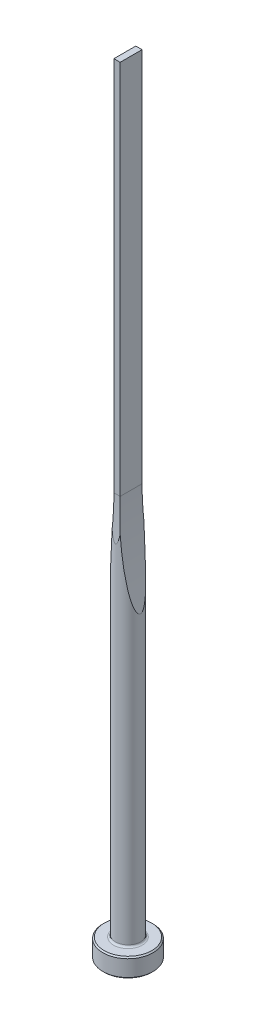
ISO-10303-21;
HEADER;
FILE_DESCRIPTION(('STEP AP214'),'2;1');
FILE_NAME('part.step','',(''),(''),'','','');
FILE_SCHEMA(('AUTOMOTIVE_DESIGN { 1 0 10303 214 1 1 1 1 }'));
ENDSEC;
DATA;
#1=APPLICATION_CONTEXT('core data for automotive mechanical design processes');
#2=APPLICATION_PROTOCOL_DEFINITION('international standard','automotive_design',2000,#1);
#3=PRODUCT_CONTEXT('',#1,'mechanical');
#4=PRODUCT('Part','Part','',(#3));
#5=PRODUCT_RELATED_PRODUCT_CATEGORY('part','',(#4));
#6=PRODUCT_DEFINITION_FORMATION('','',#4);
#7=PRODUCT_DEFINITION_CONTEXT('part definition',#1,'design');
#8=PRODUCT_DEFINITION('design','',#6,#7);
#9=PRODUCT_DEFINITION_SHAPE('','',#8);
#10=(LENGTH_UNIT() NAMED_UNIT(*) SI_UNIT(.MILLI.,.METRE.));
#11=(NAMED_UNIT(*) PLANE_ANGLE_UNIT() SI_UNIT($,.RADIAN.));
#12=(NAMED_UNIT(*) SI_UNIT($,.STERADIAN.) SOLID_ANGLE_UNIT());
#13=UNCERTAINTY_MEASURE_WITH_UNIT(LENGTH_MEASURE(1.E-05),#10,'distance_accuracy_value','');
#14=(GEOMETRIC_REPRESENTATION_CONTEXT(3) GLOBAL_UNCERTAINTY_ASSIGNED_CONTEXT((#13)) GLOBAL_UNIT_ASSIGNED_CONTEXT((#10,
#11,#12)) REPRESENTATION_CONTEXT('',''));
#15=CARTESIAN_POINT('',(0.,0.,0.));
#16=DIRECTION('',(0.,0.,1.));
#17=DIRECTION('',(1.,0.,0.));
#18=AXIS2_PLACEMENT_3D('',#15,#16,#17);
#19=CARTESIAN_POINT('',(0.,0.,0.));
#20=DIRECTION('',(0.,1.,0.));
#21=DIRECTION('',(-1.,0.,0.));
#22=AXIS2_PLACEMENT_3D('',#19,#20,#21);
#23=PLANE('',#22);
#24=CARTESIAN_POINT('',(0.,0.,0.));
#25=DIRECTION('',(0.,1.,0.));
#26=DIRECTION('',(-1.,0.,0.));
#27=AXIS2_PLACEMENT_3D('',#24,#25,#26);
#28=CIRCLE('',#27,3.8);
#29=CARTESIAN_POINT('',(-3.8,0.,0.));
#30=VERTEX_POINT('',#29);
#31=EDGE_CURVE('E133',#30,#30,#28,.T.);
#32=ORIENTED_EDGE('',*,*,#31,.F.);
#33=EDGE_LOOP('',(#32));
#34=FACE_BOUND('',#33,.T.);
#35=ADVANCED_FACE('F32',(#34),#23,.F.);
#36=CARTESIAN_POINT('',(0.,0.,0.));
#37=DIRECTION('',(0.,1.,0.));
#38=DIRECTION('',(-1.,0.,0.));
#39=AXIS2_PLACEMENT_3D('',#36,#37,#38);
#40=CONICAL_SURFACE('',#39,3.8,0.785398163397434);
#41=CARTESIAN_POINT('',(0.,0.200000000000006,0.));
#42=DIRECTION('',(0.,1.,0.));
#43=DIRECTION('',(-1.,0.,0.));
#44=AXIS2_PLACEMENT_3D('',#41,#42,#43);
#45=CIRCLE('',#44,4.);
#46=CARTESIAN_POINT('',(-4.,0.200000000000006,0.));
#47=VERTEX_POINT('',#46);
#48=EDGE_CURVE('E130',#47,#47,#45,.T.);
#49=ORIENTED_EDGE('',*,*,#48,.F.);
#50=EDGE_LOOP('',(#49));
#51=FACE_BOUND('',#50,.T.);
#52=ORIENTED_EDGE('',*,*,#31,.T.);
#53=EDGE_LOOP('',(#52));
#54=FACE_BOUND('',#53,.T.);
#55=ADVANCED_FACE('F171',(#51,#54),#40,.T.);
#56=CARTESIAN_POINT('',(0.,125.,0.));
#57=DIRECTION('',(0.,1.,0.));
#58=DIRECTION('',(-1.,0.,0.));
#59=AXIS2_PLACEMENT_3D('',#56,#57,#58);
#60=CYLINDRICAL_SURFACE('',#59,4.);
#61=CARTESIAN_POINT('',(0.,2.8,0.));
#62=DIRECTION('',(0.,1.,0.));
#63=DIRECTION('',(-1.,0.,0.));
#64=AXIS2_PLACEMENT_3D('',#61,#62,#63);
#65=CIRCLE('',#64,4.);
#66=CARTESIAN_POINT('',(-4.,2.8,0.));
#67=VERTEX_POINT('',#66);
#68=EDGE_CURVE('E127',#67,#67,#65,.T.);
#69=ORIENTED_EDGE('',*,*,#68,.F.);
#70=EDGE_LOOP('',(#69));
#71=FACE_BOUND('',#70,.T.);
#72=ORIENTED_EDGE('',*,*,#48,.T.);
#73=EDGE_LOOP('',(#72));
#74=FACE_BOUND('',#73,.T.);
#75=ADVANCED_FACE('F176',(#71,#74),#60,.T.);
#76=CARTESIAN_POINT('',(0.,2.8,0.));
#77=DIRECTION('',(0.,-1.,0.));
#78=DIRECTION('',(1.,0.,0.));
#79=AXIS2_PLACEMENT_3D('',#76,#77,#78);
#80=CONICAL_SURFACE('',#79,4.,0.785398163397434);
#81=CARTESIAN_POINT('',(0.,3.,0.));
#82=DIRECTION('',(0.,1.,0.));
#83=DIRECTION('',(-1.,0.,0.));
#84=AXIS2_PLACEMENT_3D('',#81,#82,#83);
#85=CIRCLE('',#84,3.8);
#86=CARTESIAN_POINT('',(-3.8,3.,0.));
#87=VERTEX_POINT('',#86);
#88=EDGE_CURVE('E124',#87,#87,#85,.T.);
#89=ORIENTED_EDGE('',*,*,#88,.F.);
#90=EDGE_LOOP('',(#89));
#91=FACE_BOUND('',#90,.T.);
#92=ORIENTED_EDGE('',*,*,#68,.T.);
#93=EDGE_LOOP('',(#92));
#94=FACE_BOUND('',#93,.T.);
#95=ADVANCED_FACE('F183',(#91,#94),#80,.T.);
#96=CARTESIAN_POINT('',(3.8,3.,0.));
#97=DIRECTION('',(0.,-1.,0.));
#98=DIRECTION('',(1.,0.,0.));
#99=AXIS2_PLACEMENT_3D('',#96,#97,#98);
#100=PLANE('',#99);
#101=CARTESIAN_POINT('',(0.,3.,0.));
#102=DIRECTION('',(0.,1.,0.));
#103=DIRECTION('',(-1.,0.,0.));
#104=AXIS2_PLACEMENT_3D('',#101,#102,#103);
#105=CIRCLE('',#104,2.30000000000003);
#106=CARTESIAN_POINT('',(-2.30000000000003,3.,0.));
#107=VERTEX_POINT('',#106);
#108=EDGE_CURVE('E121',#107,#107,#105,.T.);
#109=ORIENTED_EDGE('',*,*,#108,.F.);
#110=EDGE_LOOP('',(#109));
#111=FACE_BOUND('',#110,.T.);
#112=ORIENTED_EDGE('',*,*,#88,.T.);
#113=EDGE_LOOP('',(#112));
#114=FACE_BOUND('',#113,.T.);
#115=ADVANCED_FACE('F190',(#111,#114),#100,.F.);
#116=CARTESIAN_POINT('',(0.,3.3,0.));
#117=DIRECTION('',(0.,1.,0.));
#118=DIRECTION('',(-1.,0.,0.));
#119=AXIS2_PLACEMENT_3D('',#116,#117,#118);
#120=TOROIDAL_SURFACE('',#119,2.30000000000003,0.3);
#121=CARTESIAN_POINT('',(0.,3.3,0.));
#122=DIRECTION('',(0.,1.,0.));
#123=DIRECTION('',(-1.,0.,0.));
#124=AXIS2_PLACEMENT_3D('',#121,#122,#123);
#125=CIRCLE('',#124,2.00000000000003);
#126=CARTESIAN_POINT('',(-2.00000000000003,3.3,0.));
#127=VERTEX_POINT('',#126);
#128=EDGE_CURVE('E112',#127,#127,#125,.T.);
#129=ORIENTED_EDGE('',*,*,#128,.F.);
#130=EDGE_LOOP('',(#129));
#131=FACE_BOUND('',#130,.T.);
#132=ORIENTED_EDGE('',*,*,#108,.T.);
#133=EDGE_LOOP('',(#132));
#134=FACE_BOUND('',#133,.T.);
#135=ADVANCED_FACE('F168',(#131,#134),#120,.F.);
#136=CARTESIAN_POINT('',(0.,125.,0.));
#137=DIRECTION('',(0.,1.,0.));
#138=DIRECTION('',(-1.,0.,0.));
#139=AXIS2_PLACEMENT_3D('',#136,#137,#138);
#140=CYLINDRICAL_SURFACE('',#139,2.00000000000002);
#141=CARTESIAN_POINT('',(2.00000000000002,48.6369318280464,0.));
#142=CARTESIAN_POINT('',(1.99999959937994,48.6369339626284,0.0223459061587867));
#143=CARTESIAN_POINT('',(1.99962083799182,48.6389821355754,0.0447004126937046));
#144=CARTESIAN_POINT('',(1.99815425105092,48.6469172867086,0.0886950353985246));
#145=CARTESIAN_POINT('',(1.99706543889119,48.6528096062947,0.110334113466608));
#146=CARTESIAN_POINT('',(1.9938912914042,48.6700025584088,0.158557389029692));
#147=CARTESIAN_POINT('',(1.99160771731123,48.6823805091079,0.184738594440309));
#148=CARTESIAN_POINT('',(1.98633144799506,48.7110254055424,0.234784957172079));
#149=CARTESIAN_POINT('',(1.98333711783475,48.7273013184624,0.258644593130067));
#150=CARTESIAN_POINT('',(1.9743629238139,48.7761726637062,0.321817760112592));
#151=CARTESIAN_POINT('',(1.96786628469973,48.8116478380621,0.358796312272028));
#152=CARTESIAN_POINT('',(1.95408957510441,48.8871713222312,0.427500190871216));
#153=CARTESIAN_POINT('',(1.94680713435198,48.92723349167,0.459208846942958));
#154=CARTESIAN_POINT('',(1.92754936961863,49.0336190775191,0.535616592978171));
#155=CARTESIAN_POINT('',(1.91526044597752,49.101920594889,0.577448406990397));
#156=CARTESIAN_POINT('',(1.89023046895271,49.2420223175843,0.654719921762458));
#157=CARTESIAN_POINT('',(1.87748839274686,49.3138305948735,0.69014389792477));
#158=CARTESIAN_POINT('',(1.85175370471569,49.4599241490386,0.756491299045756));
#159=CARTESIAN_POINT('',(1.83876009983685,49.5342208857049,0.7873888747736));
#160=CARTESIAN_POINT('',(1.81274809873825,49.6840888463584,0.845549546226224));
#161=CARTESIAN_POINT('',(1.79972975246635,49.7596583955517,0.87281705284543));
#162=CARTESIAN_POINT('',(1.77256783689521,49.9185595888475,0.926820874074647));
#163=CARTESIAN_POINT('',(1.75842768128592,50.0019813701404,0.953291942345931));
#164=CARTESIAN_POINT('',(1.73025157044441,50.1696595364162,1.00352104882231));
#165=CARTESIAN_POINT('',(1.71621563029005,50.253916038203,1.02727870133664));
#166=CARTESIAN_POINT('',(1.67431249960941,50.5077044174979,1.09523119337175));
#167=CARTESIAN_POINT('',(1.64666477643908,50.6781687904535,1.13607747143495));
#168=CARTESIAN_POINT('',(1.59207672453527,51.0210365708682,1.21137932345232));
#169=CARTESIAN_POINT('',(1.5651383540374,51.1934437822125,1.24581853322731));
#170=CARTESIAN_POINT('',(1.51214029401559,51.539263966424,1.30963761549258));
#171=CARTESIAN_POINT('',(1.486080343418,51.7126766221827,1.33901900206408));
#172=CARTESIAN_POINT('',(1.4348671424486,52.0604086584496,1.39375720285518));
#173=CARTESIAN_POINT('',(1.40971464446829,52.2347286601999,1.41911073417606));
#174=CARTESIAN_POINT('',(1.36037231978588,52.583966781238,1.46647728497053));
#175=CARTESIAN_POINT('',(1.33618256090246,52.7588849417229,1.48849006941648));
#176=CARTESIAN_POINT('',(1.28882757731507,53.108916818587,1.52967523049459));
#177=CARTESIAN_POINT('',(1.26566085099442,53.2840298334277,1.54885187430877));
#178=CARTESIAN_POINT('',(1.22032996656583,53.6346243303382,1.58481206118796));
#179=CARTESIAN_POINT('',(1.19816578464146,53.8101058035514,1.60159566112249));
#180=CARTESIAN_POINT('',(1.13349124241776,54.3346050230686,1.6486486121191));
#181=CARTESIAN_POINT('',(1.09247383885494,54.6840801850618,1.67589262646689));
#182=CARTESIAN_POINT('',(1.01449864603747,55.3839177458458,1.72420545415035));
#183=CARTESIAN_POINT('',(0.977541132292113,55.734280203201,1.74527384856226));
#184=CARTESIAN_POINT('',(0.907713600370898,56.4357442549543,1.78258876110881));
#185=CARTESIAN_POINT('',(0.874844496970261,56.7868459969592,1.79883420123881));
#186=CARTESIAN_POINT('',(0.813223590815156,57.4895706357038,1.82751742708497));
#187=CARTESIAN_POINT('',(0.784471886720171,57.8411935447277,1.83995512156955));
#188=CARTESIAN_POINT('',(0.731059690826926,58.5453720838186,1.86182337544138));
#189=CARTESIAN_POINT('',(0.706405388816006,58.8979283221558,1.8712494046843));
#190=CARTESIAN_POINT('',(0.661248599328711,59.6033645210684,1.88767631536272));
#191=CARTESIAN_POINT('',(0.640746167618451,59.9562444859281,1.89467716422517));
#192=CARTESIAN_POINT('',(0.585481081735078,61.0151631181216,1.91278651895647));
#193=CARTESIAN_POINT('',(0.556952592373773,61.7215865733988,1.92100480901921));
#194=CARTESIAN_POINT('',(0.51651754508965,63.1360547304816,1.93226157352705));
#195=CARTESIAN_POINT('',(0.50463734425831,63.8441002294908,1.93529183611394));
#196=CARTESIAN_POINT('',(0.497590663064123,65.2603118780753,1.93711555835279));
#197=CARTESIAN_POINT('',(0.502424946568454,65.9684780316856,1.9359088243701));
#198=CARTESIAN_POINT('',(0.528792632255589,67.3837383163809,1.92887969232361));
#199=CARTESIAN_POINT('',(0.550308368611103,68.090832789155,1.92306217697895));
#200=CARTESIAN_POINT('',(0.595075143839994,69.1508511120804,1.90947934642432));
#201=CARTESIAN_POINT('',(0.612079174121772,69.5040802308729,1.90414245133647));
#202=CARTESIAN_POINT('',(0.650247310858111,70.210276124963,1.89145128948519));
#203=CARTESIAN_POINT('',(0.671411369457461,70.5632429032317,1.88409704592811));
#204=CARTESIAN_POINT('',(0.717844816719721,71.2681013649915,1.8668984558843));
#205=CARTESIAN_POINT('',(0.743105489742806,71.6199937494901,1.85705937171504));
#206=CARTESIAN_POINT('',(0.797754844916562,72.3233627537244,1.83424790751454));
#207=CARTESIAN_POINT('',(0.827143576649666,72.674839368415,1.82127548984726));
#208=CARTESIAN_POINT('',(0.890074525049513,73.3777029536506,1.79136371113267));
#209=CARTESIAN_POINT('',(0.923621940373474,73.7290892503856,1.77441936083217));
#210=CARTESIAN_POINT('',(0.994816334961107,74.4311489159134,1.73550864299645));
#211=CARTESIAN_POINT('',(1.03246301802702,74.7818223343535,1.71354263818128));
#212=CARTESIAN_POINT('',(1.11158826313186,75.4802015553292,1.66329673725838));
#213=CARTESIAN_POINT('',(1.15304311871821,75.8279127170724,1.63505453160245));
#214=CARTESIAN_POINT('',(1.23992287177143,76.5221969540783,1.57020891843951));
#215=CARTESIAN_POINT('',(1.28534897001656,76.8687696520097,1.5336029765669));
#216=CARTESIAN_POINT('',(1.35631554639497,77.3868414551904,1.47016943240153));
#217=CARTESIAN_POINT('',(1.38041701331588,77.5590642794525,1.44763070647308));
#218=CARTESIAN_POINT('',(1.42954752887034,77.9028929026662,1.39913926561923));
#219=CARTESIAN_POINT('',(1.45457653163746,78.0744987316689,1.37318671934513));
#220=CARTESIAN_POINT('',(1.50551075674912,78.4168108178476,1.31714471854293));
#221=CARTESIAN_POINT('',(1.53141549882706,78.5875175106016,1.28705750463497));
#222=CARTESIAN_POINT('',(1.58405064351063,78.9277984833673,1.22170129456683));
#223=CARTESIAN_POINT('',(1.61078090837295,79.0973729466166,1.18643315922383));
#224=CARTESIAN_POINT('',(1.65397046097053,79.3663968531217,1.1247945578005));
#225=CARTESIAN_POINT('',(1.67019715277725,79.4663857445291,1.10061905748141));
#226=CARTESIAN_POINT('',(1.70287155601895,79.6656117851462,1.04935942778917));
#227=CARTESIAN_POINT('',(1.71931932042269,79.7648487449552,1.02227459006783));
#228=CARTESIAN_POINT('',(1.75239134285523,79.9623523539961,0.964487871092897));
#229=CARTESIAN_POINT('',(1.7690157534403,80.0606179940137,0.933782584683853));
#230=CARTESIAN_POINT('',(1.80232271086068,80.2555503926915,0.867756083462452));
#231=CARTESIAN_POINT('',(1.81900523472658,80.3522177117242,0.832436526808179));
#232=CARTESIAN_POINT('',(1.85233564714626,80.543520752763,0.755409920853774));
#233=CARTESIAN_POINT('',(1.86898314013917,80.6381469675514,0.713678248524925));
#234=CARTESIAN_POINT('',(1.89355523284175,80.7765692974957,0.64423596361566));
#235=CARTESIAN_POINT('',(1.90166612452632,80.8220505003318,0.619994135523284));
#236=CARTESIAN_POINT('',(1.91766149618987,80.9113598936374,0.568591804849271));
#237=CARTESIAN_POINT('',(1.92554594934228,80.9551878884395,0.541430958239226));
#238=CARTESIAN_POINT('',(1.94445150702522,81.0598482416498,0.470167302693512));
#239=CARTESIAN_POINT('',(1.95527858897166,81.1194068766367,0.423957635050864));
#240=CARTESIAN_POINT('',(1.97014146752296,81.2007698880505,0.345325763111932));
#241=CARTESIAN_POINT('',(1.97489054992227,81.2266935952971,0.317364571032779));
#242=CARTESIAN_POINT('',(1.9835631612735,81.2739354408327,0.257652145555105));
#243=CARTESIAN_POINT('',(1.98748960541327,81.2952698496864,0.225914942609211));
#244=CARTESIAN_POINT('',(1.99266849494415,81.323369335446,0.172252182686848));
#245=CARTESIAN_POINT('',(1.994357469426,81.3325227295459,0.151632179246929));
#246=CARTESIAN_POINT('',(1.9971302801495,81.3475413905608,0.109184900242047));
#247=CARTESIAN_POINT('',(1.99821491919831,81.3534110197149,0.0873592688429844));
#248=CARTESIAN_POINT('',(1.99966711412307,81.3612681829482,0.0427916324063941));
#249=CARTESIAN_POINT('',(2.00002878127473,81.3632238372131,0.0200436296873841));
#250=CARTESIAN_POINT('',(1.99996760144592,81.3628929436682,-0.0254230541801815));
#251=CARTESIAN_POINT('',(1.99954467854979,81.36060598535,-0.0481417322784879));
#252=CARTESIAN_POINT('',(1.99804295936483,81.3524803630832,-0.0907709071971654));
#253=CARTESIAN_POINT('',(1.9970263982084,81.3469786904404,-0.110750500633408));
#254=CARTESIAN_POINT('',(1.99448592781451,81.3332185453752,-0.14969018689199));
#255=CARTESIAN_POINT('',(1.99296174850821,81.3249586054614,-0.168649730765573));
#256=CARTESIAN_POINT('',(1.988312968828,81.2997396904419,-0.218154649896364));
#257=CARTESIAN_POINT('',(1.98481178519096,81.280721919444,-0.24760872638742));
#258=CARTESIAN_POINT('',(1.97706913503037,81.2385707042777,-0.30329923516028));
#259=CARTESIAN_POINT('',(1.97282513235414,81.2154231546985,-0.329524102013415));
#260=CARTESIAN_POINT('',(1.95935725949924,81.1417794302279,-0.404383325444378));
#261=CARTESIAN_POINT('',(1.94943417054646,81.0872801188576,-0.448889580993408));
#262=CARTESIAN_POINT('',(1.92879683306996,80.9732711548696,-0.530561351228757));
#263=CARTESIAN_POINT('',(1.91808016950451,80.9137461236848,-0.567703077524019));
#264=CARTESIAN_POINT('',(1.89724400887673,80.7973037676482,-0.633676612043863));
#265=CARTESIAN_POINT('',(1.88715715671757,80.7406313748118,-0.662954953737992));
#266=CARTESIAN_POINT('',(1.86682157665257,80.6257191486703,-0.718219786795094));
#267=CARTESIAN_POINT('',(1.856572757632,80.5674784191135,-0.744204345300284));
#268=CARTESIAN_POINT('',(1.82568757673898,80.3909251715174,-0.818391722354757));
#269=CARTESIAN_POINT('',(1.80495249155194,80.2710047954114,-0.862710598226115));
#270=CARTESIAN_POINT('',(1.76350002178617,80.0282684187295,-0.944537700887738));
#271=CARTESIAN_POINT('',(1.74278323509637,79.9054410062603,-0.9820110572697));
#272=CARTESIAN_POINT('',(1.70165653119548,79.6584394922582,-1.05166411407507));
#273=CARTESIAN_POINT('',(1.68124623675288,79.5342674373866,-1.08385090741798));
#274=CARTESIAN_POINT('',(1.64101494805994,79.2862310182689,-1.14383417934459));
#275=CARTESIAN_POINT('',(1.62118998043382,79.1623776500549,-1.17167406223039));
#276=CARTESIAN_POINT('',(1.58195540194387,78.9139199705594,-1.22412636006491));
#277=CARTESIAN_POINT('',(1.56254582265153,78.7893156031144,-1.24873853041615));
#278=CARTESIAN_POINT('',(1.50498233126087,78.4145704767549,-1.31859618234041));
#279=CARTESIAN_POINT('',(1.46750707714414,78.1635803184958,-1.35984370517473));
#280=CARTESIAN_POINT('',(1.39446681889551,77.6597358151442,-1.43463394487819));
#281=CARTESIAN_POINT('',(1.35890544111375,77.4068788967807,-1.46816240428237));
#282=CARTESIAN_POINT('',(1.28985321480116,76.900212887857,-1.5291826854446));
#283=CARTESIAN_POINT('',(1.25636197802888,76.6464039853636,-1.5566756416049));
#284=CARTESIAN_POINT('',(1.19153191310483,76.1383585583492,-1.6068375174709));
#285=CARTESIAN_POINT('',(1.16019052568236,75.8841229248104,-1.62951224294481));
#286=CARTESIAN_POINT('',(1.09964458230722,75.3750740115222,-1.67096428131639));
#287=CARTESIAN_POINT('',(1.07044011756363,75.1202607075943,-1.68974142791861));
#288=CARTESIAN_POINT('',(0.986119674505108,74.3556408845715,-1.74124672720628));
#289=CARTESIAN_POINT('',(0.934232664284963,73.8451532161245,-1.76919522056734));
#290=CARTESIAN_POINT('',(0.839538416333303,72.8269457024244,-1.81601562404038));
#291=CARTESIAN_POINT('',(0.796663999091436,72.319235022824,-1.83495612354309));
#292=CARTESIAN_POINT('',(0.719531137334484,71.3029451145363,-1.86655063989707));
#293=CARTESIAN_POINT('',(0.685273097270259,70.7943658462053,-1.87920436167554));
#294=CARTESIAN_POINT('',(0.625385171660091,69.7763705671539,-1.8999721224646));
#295=CARTESIAN_POINT('',(0.599759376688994,69.2669542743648,-1.90808401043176));
#296=CARTESIAN_POINT('',(0.557171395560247,68.2477280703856,-1.92095127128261));
#297=CARTESIAN_POINT('',(0.540209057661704,67.7379181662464,-1.92570670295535));
#298=CARTESIAN_POINT('',(0.514960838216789,66.7183267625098,-1.93261112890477));
#299=CARTESIAN_POINT('',(0.506670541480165,66.2085453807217,-1.93476144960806));
#300=CARTESIAN_POINT('',(0.49875418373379,65.1889064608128,-1.93681718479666));
#301=CARTESIAN_POINT('',(0.499128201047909,64.6790489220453,-1.93672257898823));
#302=CARTESIAN_POINT('',(0.50853954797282,63.6595267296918,-1.93427286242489));
#303=CARTESIAN_POINT('',(0.517575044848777,63.1498620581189,-1.93191822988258));
#304=CARTESIAN_POINT('',(0.544302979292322,62.1307884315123,-1.92455879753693));
#305=CARTESIAN_POINT('',(0.561995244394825,61.6213794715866,-1.91955405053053));
#306=CARTESIAN_POINT('',(0.606629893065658,60.5890885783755,-1.90592838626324));
#307=CARTESIAN_POINT('',(0.633811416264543,60.0662181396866,-1.89721255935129));
#308=CARTESIAN_POINT('',(0.697287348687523,59.0211319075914,-1.87481290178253));
#309=CARTESIAN_POINT('',(0.733581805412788,58.4989161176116,-1.86112904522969));
#310=CARTESIAN_POINT('',(0.815237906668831,57.45566137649,-1.82684566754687));
#311=CARTESIAN_POINT('',(0.860595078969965,56.9346219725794,-1.80624955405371));
#312=CARTESIAN_POINT('',(0.935398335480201,56.1540708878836,-1.76799386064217));
#313=CARTESIAN_POINT('',(0.961461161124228,55.8940508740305,-1.75401474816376));
#314=CARTESIAN_POINT('',(1.01583096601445,55.3744231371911,-1.72309839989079));
#315=CARTESIAN_POINT('',(1.04413791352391,55.1148154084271,-1.70616120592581));
#316=CARTESIAN_POINT('',(1.11329294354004,54.5051986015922,-1.66216858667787));
#317=CARTESIAN_POINT('',(1.15505916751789,54.1553968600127,-1.63364746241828));
#318=CARTESIAN_POINT('',(1.24258843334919,53.4571129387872,-1.56811548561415));
#319=CARTESIAN_POINT('',(1.28835090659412,53.1086305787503,-1.53110583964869));
#320=CARTESIAN_POINT('',(1.36851706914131,52.5245931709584,-1.45912605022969));
#321=CARTESIAN_POINT('',(1.40188146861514,52.2885124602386,-1.42727858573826));
#322=CARTESIAN_POINT('',(1.47033119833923,51.8176392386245,-1.3566744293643));
#323=CARTESIAN_POINT('',(1.50541631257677,51.5828465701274,-1.31791860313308));
#324=CARTESIAN_POINT('',(1.56586956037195,51.1888918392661,-1.24480040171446));
#325=CARTESIAN_POINT('',(1.59081615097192,51.0292096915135,-1.21290136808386));
#326=CARTESIAN_POINT('',(1.64138444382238,50.7111106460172,-1.14355345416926));
#327=CARTESIAN_POINT('',(1.66700624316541,50.5526939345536,-1.1061037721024));
#328=CARTESIAN_POINT('',(1.71077059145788,50.2865745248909,-1.03652475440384));
#329=CARTESIAN_POINT('',(1.72877472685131,50.178344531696,-1.0063337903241));
#330=CARTESIAN_POINT('',(1.76494280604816,49.9633285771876,-0.941469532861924));
#331=CARTESIAN_POINT('',(1.78310661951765,49.856541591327,-0.906799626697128));
#332=CARTESIAN_POINT('',(1.81396089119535,49.6770737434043,-0.842848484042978));
#333=CARTESIAN_POINT('',(1.82664500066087,49.6038471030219,-0.81510950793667));
#334=CARTESIAN_POINT('',(1.85195768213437,49.4587636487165,-0.755839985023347));
#335=CARTESIAN_POINT('',(1.86458610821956,49.3869096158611,-0.724302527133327));
#336=CARTESIAN_POINT('',(1.89040343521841,49.2410282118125,-0.654124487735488));
#337=CARTESIAN_POINT('',(1.90357788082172,49.1671467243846,-0.615162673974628));
#338=CARTESIAN_POINT('',(1.92281794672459,49.0599829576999,-0.550693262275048));
#339=CARTESIAN_POINT('',(1.92913565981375,49.0249192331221,-0.528235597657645));
#340=CARTESIAN_POINT('',(1.94150282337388,48.9565035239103,-0.480802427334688));
#341=CARTESIAN_POINT('',(1.94755251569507,48.9231499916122,-0.455829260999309));
#342=CARTESIAN_POINT('',(1.95806876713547,48.8653447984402,-0.407971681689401));
#343=CARTESIAN_POINT('',(1.96261120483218,48.8404403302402,-0.385656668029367));
#344=CARTESIAN_POINT('',(1.97129564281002,48.7929309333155,-0.338482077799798));
#345=CARTESIAN_POINT('',(1.97543676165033,48.7703310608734,-0.313617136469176));
#346=CARTESIAN_POINT('',(1.98314721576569,48.728330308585,-0.260502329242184));
#347=CARTESIAN_POINT('',(1.98670628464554,48.708986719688,-0.232204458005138));
#348=CARTESIAN_POINT('',(1.99278059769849,48.6760177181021,-0.172374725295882));
#349=CARTESIAN_POINT('',(1.99530171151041,48.6623601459,-0.140862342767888));
#350=CARTESIAN_POINT('',(1.99802431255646,48.6476201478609,-0.0906024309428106));
#351=CARTESIAN_POINT('',(1.99875930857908,48.6436433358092,-0.0727259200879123));
#352=CARTESIAN_POINT('',(1.99974726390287,48.6382985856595,-0.0365681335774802));
#353=CARTESIAN_POINT('',(2.00000032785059,48.6369300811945,-0.018286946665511));
#354=CARTESIAN_POINT('',(2.00000000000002,48.6369318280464,0.));
#355=B_SPLINE_CURVE_WITH_KNOTS('',3,(#141,#142,#143,#144,#145,#146,#147,#148,#149,#150,#151,
#152,#153,#154,#155,#156,#157,#158,#159,#160,#161,#162,#163,#164,#165,#166,#167,#168,#169,#170,
#171,#172,#173,#174,#175,#176,#177,#178,#179,#180,#181,#182,#183,#184,#185,#186,#187,#188,#189,
#190,#191,#192,#193,#194,#195,#196,#197,#198,#199,#200,#201,#202,#203,#204,#205,#206,#207,#208,
#209,#210,#211,#212,#213,#214,#215,#216,#217,#218,#219,#220,#221,#222,#223,#224,#225,#226,#227,
#228,#229,#230,#231,#232,#233,#234,#235,#236,#237,#238,#239,#240,#241,#242,#243,#244,#245,#246,
#247,#248,#249,#250,#251,#252,#253,#254,#255,#256,#257,#258,#259,#260,#261,#262,#263,#264,#265,
#266,#267,#268,#269,#270,#271,#272,#273,#274,#275,#276,#277,#278,#279,#280,#281,#282,#283,#284,
#285,#286,#287,#288,#289,#290,#291,#292,#293,#294,#295,#296,#297,#298,#299,#300,#301,#302,#303,
#304,#305,#306,#307,#308,#309,#310,#311,#312,#313,#314,#315,#316,#317,#318,#319,#320,#321,#322,
#323,#324,#325,#326,#327,#328,#329,#330,#331,#332,#333,#334,#335,#336,#337,#338,#339,#340,#341,
#342,#343,#344,#345,#346,#347,#348,#349,#350,#351,#352,#353,#354),.UNSPECIFIED.,.T.,.F.,(4,2,2,
2,2,2,2,2,2,2,2,2,2,2,2,2,2,2,2,2,2,2,2,2,2,2,2,2,2,2,2,2,2,2,2,2,2,2,2,2,2,2,2,2,2,2,2,2,2,2,2,
2,2,2,2,2,2,2,2,2,2,2,2,2,2,2,2,2,2,2,2,2,2,2,2,2,2,2,2,2,2,2,2,2,2,2,2,2,2,2,2,2,2,2,2,2,2,2,2,
2,2,2,2,2,2,2,4),(0.,0.0669624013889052,0.134018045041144,0.220670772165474,0.307524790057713,
0.461614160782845,0.616182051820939,0.858650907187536,1.10170693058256,1.34610098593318,
1.5901953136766,1.85610381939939,2.12205007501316,2.65421827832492,3.1877275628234,
3.72107686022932,4.25485865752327,4.78867798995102,5.32168579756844,5.8546809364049,
6.91335433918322,7.97209954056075,9.03108120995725,10.090088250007,11.1506808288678,
12.2112876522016,14.3321822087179,16.4564307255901,18.5807763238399,20.7028752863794,
21.7638861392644,22.8248847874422,23.8836550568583,24.9424380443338,26.0025581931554,
27.0626017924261,28.1164437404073,29.1706054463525,29.6966440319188,30.2226566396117,
30.7483853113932,31.2740267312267,31.5864186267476,31.898886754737,32.2116511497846,
32.5243034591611,32.8381878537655,32.9946058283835,33.1510422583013,33.3782257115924,
33.4932147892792,33.6077892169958,33.6754354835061,33.7429916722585,33.8110959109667,
33.8792067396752,33.9412079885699,34.003242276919,34.1083294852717,34.2137827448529,
34.4257772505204,34.6384457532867,34.8320405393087,35.0257484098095,35.4139275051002,
35.8040319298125,36.1936086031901,36.5790049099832,36.9644304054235,37.7355387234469,
38.5080600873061,39.2804361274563,40.0518761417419,40.8233490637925,42.3647732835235,
43.8942649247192,45.4238283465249,46.9541155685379,48.4843759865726,50.0138569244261,
51.5433516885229,53.0725228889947,54.6016636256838,56.1725124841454,57.7433695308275,
59.3134533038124,60.0985213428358,60.883578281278,61.9437988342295,63.003868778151,
63.7254256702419,64.4468922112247,64.9410344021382,65.4352480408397,65.7765660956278,
66.1176275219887,66.3555218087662,66.5938556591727,66.8471216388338,66.9733921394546,
67.0995462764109,67.200658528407,67.301988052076,67.4049471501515,67.5073157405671,
67.562126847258,67.6169260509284),.UNSPECIFIED.);
#356=CARTESIAN_POINT('',(0.643611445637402,59.9177331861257,-1.89361144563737));
#357=VERTEX_POINT('',#356);
#358=CARTESIAN_POINT('',(0.643611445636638,59.9177331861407,1.89361144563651));
#359=VERTEX_POINT('',#358);
#360=EDGE_CURVE('E138',#357,#359,#355,.T.);
#361=ORIENTED_EDGE('',*,*,#360,.T.);
#362=CARTESIAN_POINT('',(-0.96824583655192,65.,1.74999999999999));
#363=CARTESIAN_POINT('',(-0.968238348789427,65.3335504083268,1.74999985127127));
#364=CARTESIAN_POINT('',(-0.964913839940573,65.6670930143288,1.75185441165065));
#365=CARTESIAN_POINT('',(-0.951335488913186,66.3339943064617,1.75926912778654));
#366=CARTESIAN_POINT('',(-0.941081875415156,66.667352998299,1.76482916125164));
#367=CARTESIAN_POINT('',(-0.912720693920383,67.3344915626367,1.77966177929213));
#368=CARTESIAN_POINT('',(-0.894593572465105,67.6682704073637,1.78894360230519));
#369=CARTESIAN_POINT('',(-0.848686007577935,68.3349608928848,1.81119198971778));
#370=CARTESIAN_POINT('',(-0.820909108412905,68.6678728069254,1.82415720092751));
#371=CARTESIAN_POINT('',(-0.769005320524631,69.1665035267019,1.84634021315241));
#372=CARTESIAN_POINT('',(-0.749965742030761,69.3328098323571,1.85420260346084));
#373=CARTESIAN_POINT('',(-0.707487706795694,69.6649255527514,1.87082483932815));
#374=CARTESIAN_POINT('',(-0.684046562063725,69.8307346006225,1.87958523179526));
#375=CARTESIAN_POINT('',(-0.631397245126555,70.1606520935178,1.89792815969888));
#376=CARTESIAN_POINT('',(-0.602215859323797,70.3247648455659,1.90750676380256));
#377=CARTESIAN_POINT('',(-0.551786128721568,70.5694473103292,1.92245449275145));
#378=CARTESIAN_POINT('',(-0.53387819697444,70.6507164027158,1.92753077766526));
#379=CARTESIAN_POINT('',(-0.49509309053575,70.8125239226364,1.9378564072));
#380=CARTESIAN_POINT('',(-0.47421634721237,70.8930624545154,1.94310572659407));
#381=CARTESIAN_POINT('',(-0.428292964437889,71.053075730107,1.95374902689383));
#382=CARTESIAN_POINT('',(-0.403242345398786,71.132549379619,1.95914314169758));
#383=CARTESIAN_POINT('',(-0.360560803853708,71.2502226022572,1.96728291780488));
#384=CARTESIAN_POINT('',(-0.345421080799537,71.289323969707,1.97001385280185));
#385=CARTESIAN_POINT('',(-0.312809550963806,71.366532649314,1.97545600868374));
#386=CARTESIAN_POINT('',(-0.29534055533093,71.4046410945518,1.97816724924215));
#387=CARTESIAN_POINT('',(-0.256751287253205,71.4796372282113,1.98354888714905));
#388=CARTESIAN_POINT('',(-0.235581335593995,71.5164989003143,1.98621810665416));
#389=CARTESIAN_POINT('',(-0.187728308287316,71.586387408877,1.99131986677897));
#390=CARTESIAN_POINT('',(-0.161126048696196,71.6194604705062,1.99375518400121));
#391=CARTESIAN_POINT('',(-0.120751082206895,71.6547640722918,1.99636953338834));
#392=CARTESIAN_POINT('',(-0.111560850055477,71.662036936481,1.99690919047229));
#393=CARTESIAN_POINT('',(-0.0922735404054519,71.6752894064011,1.99789387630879));
#394=CARTESIAN_POINT('',(-0.082177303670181,71.6812701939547,1.99833899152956));
#395=CARTESIAN_POINT('',(-0.0632207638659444,71.6903867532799,1.99901815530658));
#396=CARTESIAN_POINT('',(-0.0545231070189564,71.6938532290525,1.99927668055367));
#397=CARTESIAN_POINT('',(-0.0366717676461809,71.6993072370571,1.99968362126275));
#398=CARTESIAN_POINT('',(-0.0275187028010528,71.7012967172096,1.99983218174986));
#399=CARTESIAN_POINT('',(-0.00893111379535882,71.7035672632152,2.00000174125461));
#400=CARTESIAN_POINT('',(0.000504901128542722,71.7038366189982,2.00002186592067));
#401=CARTESIAN_POINT('',(0.0192584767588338,71.7025973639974,1.99992930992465));
#402=CARTESIAN_POINT('',(0.0285759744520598,71.7010878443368,1.99981656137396));
#403=CARTESIAN_POINT('',(0.047938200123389,71.6961998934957,1.99945173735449));
#404=CARTESIAN_POINT('',(0.0579283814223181,71.6926115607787,1.99918401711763));
#405=CARTESIAN_POINT('',(0.0771947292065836,71.6838760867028,1.99853304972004));
#406=CARTESIAN_POINT('',(0.0864694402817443,71.6787258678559,1.99814957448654));
#407=CARTESIAN_POINT('',(0.110056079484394,71.6635871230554,1.99702403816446));
#408=CARTESIAN_POINT('',(0.1237321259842,71.6526274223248,1.99621074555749));
#409=CARTESIAN_POINT('',(0.149379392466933,71.6288928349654,1.99445462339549));
#410=CARTESIAN_POINT('',(0.161345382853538,71.6161126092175,1.99351141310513));
#411=CARTESIAN_POINT('',(0.205772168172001,71.5638954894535,1.98967042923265));
#412=CARTESIAN_POINT('',(0.233384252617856,71.520467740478,1.98650266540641));
#413=CARTESIAN_POINT('',(0.283063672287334,71.4305772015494,1.980017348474));
#414=CARTESIAN_POINT('',(0.305089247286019,71.3840946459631,1.97669887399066));
#415=CARTESIAN_POINT('',(0.346614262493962,71.2871258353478,1.96985455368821));
#416=CARTESIAN_POINT('',(0.365923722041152,71.2365569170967,1.9663268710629));
#417=CARTESIAN_POINT('',(0.401868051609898,71.1344657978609,1.95929356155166));
#418=CARTESIAN_POINT('',(0.418500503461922,71.0829427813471,1.95578795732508));
#419=CARTESIAN_POINT('',(0.46554515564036,70.9272647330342,1.94533228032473));
#420=CARTESIAN_POINT('',(0.493020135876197,70.8222195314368,1.93845882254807));
#421=CARTESIAN_POINT('',(0.543128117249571,70.6109304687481,1.9250107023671));
#422=CARTESIAN_POINT('',(0.565757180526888,70.5046857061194,1.91843628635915));
#423=CARTESIAN_POINT('',(0.607474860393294,70.2916513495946,1.90563570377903));
#424=CARTESIAN_POINT('',(0.62656867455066,70.1848627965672,1.89940903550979));
#425=CARTESIAN_POINT('',(0.679606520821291,69.8655887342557,1.88136685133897));
#426=CARTESIAN_POINT('',(0.70968808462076,69.6524380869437,1.87007721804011));
#427=CARTESIAN_POINT('',(0.762936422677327,69.2251827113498,1.84897871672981));
#428=CARTESIAN_POINT('',(0.786101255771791,69.0110777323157,1.83917026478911));
#429=CARTESIAN_POINT('',(0.827204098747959,68.5820289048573,1.82105456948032));
#430=CARTESIAN_POINT('',(0.845135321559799,68.3670843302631,1.81274928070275));
#431=CARTESIAN_POINT('',(0.876742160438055,67.9368251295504,1.79767146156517));
#432=CARTESIAN_POINT('',(0.890417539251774,67.7215104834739,1.79089901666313));
#433=CARTESIAN_POINT('',(0.926042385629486,67.0754331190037,1.77290217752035));
#434=CARTESIAN_POINT('',(0.942611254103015,66.6443036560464,1.76398841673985));
#435=CARTESIAN_POINT('',(0.964025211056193,65.7819612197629,1.75236444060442));
#436=CARTESIAN_POINT('',(0.968877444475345,65.3507484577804,1.74965044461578));
#437=CARTESIAN_POINT('',(0.967552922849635,64.5308621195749,1.75038346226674));
#438=CARTESIAN_POINT('',(0.962416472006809,64.1421864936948,1.75324937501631));
#439=CARTESIAN_POINT('',(0.942544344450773,63.3650984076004,1.76401153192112));
#440=CARTESIAN_POINT('',(0.9278074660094,62.9766859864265,1.7719084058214));
#441=CARTESIAN_POINT('',(0.88702870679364,62.2013181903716,1.79269108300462));
#442=CARTESIAN_POINT('',(0.861009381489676,61.8143614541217,1.80556692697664));
#443=CARTESIAN_POINT('',(0.810327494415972,61.2349947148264,1.82857800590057));
#444=CARTESIAN_POINT('',(0.791485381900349,61.0420037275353,1.83686705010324));
#445=CARTESIAN_POINT('',(0.748852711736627,60.6566468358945,1.85465818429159));
#446=CARTESIAN_POINT('',(0.725062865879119,60.4642808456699,1.86416009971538));
#447=CARTESIAN_POINT('',(0.67088159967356,60.0804343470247,1.88435148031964));
#448=CARTESIAN_POINT('',(0.640488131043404,59.8889541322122,1.89504131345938));
#449=CARTESIAN_POINT('',(0.587350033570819,59.6032913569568,1.91189763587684));
#450=CARTESIAN_POINT('',(0.568392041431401,59.5083825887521,1.91764989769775));
#451=CARTESIAN_POINT('',(0.52712105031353,59.3193197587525,1.92940755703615));
#452=CARTESIAN_POINT('',(0.504809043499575,59.2251654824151,1.93541287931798));
#453=CARTESIAN_POINT('',(0.467684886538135,59.0847170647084,1.94459011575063));
#454=CARTESIAN_POINT('',(0.454672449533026,59.0379428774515,1.94768347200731));
#455=CARTESIAN_POINT('',(0.427105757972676,58.9448190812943,1.95391455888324));
#456=CARTESIAN_POINT('',(0.412550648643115,58.8984697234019,1.9570523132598));
#457=CARTESIAN_POINT('',(0.381456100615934,58.8064886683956,1.96334987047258));
#458=CARTESIAN_POINT('',(0.364918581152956,58.760856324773,1.96650964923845));
#459=CARTESIAN_POINT('',(0.329109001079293,58.6706906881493,1.97282096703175));
#460=CARTESIAN_POINT('',(0.309839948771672,58.6261562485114,1.97597251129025));
#461=CARTESIAN_POINT('',(0.271876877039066,58.5487600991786,1.98150517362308));
#462=CARTESIAN_POINT('',(0.254001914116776,58.5154988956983,1.98390223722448));
#463=CARTESIAN_POINT('',(0.214436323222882,58.4511543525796,1.98857376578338));
#464=CARTESIAN_POINT('',(0.192749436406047,58.4200689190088,1.99084834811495));
#465=CARTESIAN_POINT('',(0.155344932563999,58.3773052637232,1.99399670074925));
#466=CARTESIAN_POINT('',(0.141972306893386,58.3636268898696,1.99500731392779));
#467=CARTESIAN_POINT('',(0.113107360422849,58.338736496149,1.9968511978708));
#468=CARTESIAN_POINT('',(0.0976304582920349,58.3275079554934,1.997685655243));
#469=CARTESIAN_POINT('',(0.0728302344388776,58.314017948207,1.99868989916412));
#470=CARTESIAN_POINT('',(0.0644176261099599,58.3101099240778,1.99898116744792));
#471=CARTESIAN_POINT('',(0.047084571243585,58.303629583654,1.99946443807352));
#472=CARTESIAN_POINT('',(0.0381646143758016,58.3010560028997,1.99965653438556));
#473=CARTESIAN_POINT('',(0.019921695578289,58.2975044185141,1.99992169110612));
#474=CARTESIAN_POINT('',(0.0105959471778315,58.2965401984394,1.99999372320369));
#475=CARTESIAN_POINT('',(-0.00807114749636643,58.2963827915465,2.00000547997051));
#476=CARTESIAN_POINT('',(-0.0174124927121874,58.2971894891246,1.99994521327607));
#477=CARTESIAN_POINT('',(-0.0349517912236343,58.3003116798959,1.99971209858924));
#478=CARTESIAN_POINT('',(-0.0431765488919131,58.3024835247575,1.99954996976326));
#479=CARTESIAN_POINT('',(-0.0592195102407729,58.3079903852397,1.99913919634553));
#480=CARTESIAN_POINT('',(-0.0670374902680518,58.3113260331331,1.99889050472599));
#481=CARTESIAN_POINT('',(-0.0873820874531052,58.3215216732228,1.99813112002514));
#482=CARTESIAN_POINT('',(-0.099476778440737,58.3292325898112,1.99755750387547));
#483=CARTESIAN_POINT('',(-0.12237591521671,58.3463696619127,1.99628542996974));
#484=CARTESIAN_POINT('',(-0.133175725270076,58.3558016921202,1.99558654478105));
#485=CARTESIAN_POINT('',(-0.16913761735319,58.3907343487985,1.99300462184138));
#486=CARTESIAN_POINT('',(-0.191472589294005,58.4190676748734,1.99092143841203));
#487=CARTESIAN_POINT('',(-0.232121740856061,58.4784605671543,1.98658628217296));
#488=CARTESIAN_POINT('',(-0.25040873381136,58.5095367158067,1.98433329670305));
#489=CARTESIAN_POINT('',(-0.298259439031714,58.599158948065,1.97788536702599));
#490=CARTESIAN_POINT('',(-0.324764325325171,58.6593227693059,1.97361381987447));
#491=CARTESIAN_POINT('',(-0.372968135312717,58.7815788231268,1.9650622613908));
#492=CARTESIAN_POINT('',(-0.394653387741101,58.8436759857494,1.960782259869));
#493=CARTESIAN_POINT('',(-0.434799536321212,58.9690531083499,1.95227381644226));
#494=CARTESIAN_POINT('',(-0.453253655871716,59.0323352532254,1.9480454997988));
#495=CARTESIAN_POINT('',(-0.487767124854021,59.1594430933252,1.93968904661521));
#496=CARTESIAN_POINT('',(-0.503829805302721,59.2232678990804,1.93556077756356));
#497=CARTESIAN_POINT('',(-0.549032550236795,59.4141586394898,1.92341977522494));
#498=CARTESIAN_POINT('',(-0.575547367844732,59.541854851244,1.91556836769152));
#499=CARTESIAN_POINT('',(-0.623901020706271,59.7981698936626,1.90036186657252));
#500=CARTESIAN_POINT('',(-0.645738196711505,59.926789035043,1.89300694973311));
#501=CARTESIAN_POINT('',(-0.68594490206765,60.1847819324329,1.8788122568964));
#502=CARTESIAN_POINT('',(-0.704309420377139,60.3141565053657,1.8719732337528));
#503=CARTESIAN_POINT('',(-0.738276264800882,60.5732979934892,1.8588372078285));
#504=CARTESIAN_POINT('',(-0.753878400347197,60.7030649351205,1.85254024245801));
#505=CARTESIAN_POINT('',(-0.797266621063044,61.0924514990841,1.83449232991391));
#506=CARTESIAN_POINT('',(-0.821682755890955,61.3524855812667,1.82356626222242));
#507=CARTESIAN_POINT('',(-0.863851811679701,61.8729662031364,1.80396364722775));
#508=CARTESIAN_POINT('',(-0.881609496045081,62.1334123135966,1.79528549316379));
#509=CARTESIAN_POINT('',(-0.909188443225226,62.6109686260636,1.78145202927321));
#510=CARTESIAN_POINT('',(-0.91984124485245,62.828021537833,1.77594999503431));
#511=CARTESIAN_POINT('',(-0.937831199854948,63.2623322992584,1.76651427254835));
#512=CARTESIAN_POINT('',(-0.945167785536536,63.479590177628,1.76258085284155));
#513=CARTESIAN_POINT('',(-0.96263848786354,64.1311260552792,1.75314663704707));
#514=CARTESIAN_POINT('',(-0.968255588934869,64.5655696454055,1.75000019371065));
#515=CARTESIAN_POINT('',(-0.96824583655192,65.,1.74999999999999));
#516=B_SPLINE_CURVE_WITH_KNOTS('',3,(#362,#363,#364,#365,#366,#367,#368,#369,#370,#371,#372,
#373,#374,#375,#376,#377,#378,#379,#380,#381,#382,#383,#384,#385,#386,#387,#388,#389,#390,#391,
#392,#393,#394,#395,#396,#397,#398,#399,#400,#401,#402,#403,#404,#405,#406,#407,#408,#409,#410,
#411,#412,#413,#414,#415,#416,#417,#418,#419,#420,#421,#422,#423,#424,#425,#426,#427,#428,#429,
#430,#431,#432,#433,#434,#435,#436,#437,#438,#439,#440,#441,#442,#443,#444,#445,#446,#447,#448,
#449,#450,#451,#452,#453,#454,#455,#456,#457,#458,#459,#460,#461,#462,#463,#464,#465,#466,#467,
#468,#469,#470,#471,#472,#473,#474,#475,#476,#477,#478,#479,#480,#481,#482,#483,#484,#485,#486,
#487,#488,#489,#490,#491,#492,#493,#494,#495,#496,#497,#498,#499,#500,#501,#502,#503,#504,#505,
#506,#507,#508,#509,#510,#511,#512,#513,#514,#515),.UNSPECIFIED.,.T.,.F.,(4,2,2,2,2,2,2,2,2,2,2,
2,2,2,2,2,2,2,2,2,2,2,2,2,2,2,2,2,2,2,2,2,2,2,2,2,2,2,2,2,2,2,2,2,2,2,2,2,2,2,2,2,2,2,2,2,2,2,2,
2,2,2,2,2,2,2,2,2,2,2,2,2,2,2,2,2,4),(0.,1.00061581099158,2.00119860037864,3.00428062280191,
4.00699461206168,4.50967978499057,5.0126729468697,5.51337234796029,5.76344921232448,
6.01348977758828,6.26377012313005,6.38978922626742,6.51565759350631,6.6433674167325,
6.76930011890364,6.80441740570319,6.83950243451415,6.86749611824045,6.89545281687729,
6.92359963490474,6.95176084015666,6.98343981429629,7.01518161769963,7.06751713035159,
7.12000941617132,7.27346664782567,7.42803926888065,7.59061961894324,7.75334601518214,
8.07950203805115,8.40592210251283,8.73185838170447,9.37833492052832,10.024992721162,
10.6724854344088,11.3200142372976,12.6143689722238,13.907934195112,15.0739514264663,
16.2401146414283,17.4039571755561,17.9861616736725,18.5682824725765,19.1505840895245,
19.4414102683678,19.7321505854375,19.878079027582,20.024088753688,20.1699582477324,
20.3156683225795,20.4290845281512,20.5423900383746,20.5997121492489,20.6566348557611,
20.6843886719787,20.7121161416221,20.7400798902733,20.768041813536,20.7934648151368,
20.8189016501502,20.8617157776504,20.9046788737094,21.012255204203,21.1205334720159,
21.3176552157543,21.5153291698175,21.7134128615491,21.9112180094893,22.30302776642,
22.6949762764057,23.087486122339,23.4800230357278,24.2640993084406,25.047613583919,
25.6997303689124,26.3519587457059,27.6552036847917),.UNSPECIFIED.);
#517=CARTESIAN_POINT('',(-0.643611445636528,59.9177331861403,1.89361144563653));
#518=VERTEX_POINT('',#517);
#519=EDGE_CURVE('E104',#359,#518,#516,.T.);
#520=ORIENTED_EDGE('',*,*,#519,.T.);
#521=CARTESIAN_POINT('',(-2.00000000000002,48.6369318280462,0.));
#522=CARTESIAN_POINT('',(-1.99999959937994,48.6369339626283,-0.0223459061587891));
#523=CARTESIAN_POINT('',(-1.99962083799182,48.6389821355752,-0.0447004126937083));
#524=CARTESIAN_POINT('',(-1.99815425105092,48.6469172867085,-0.088695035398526));
#525=CARTESIAN_POINT('',(-1.9970654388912,48.6528096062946,-0.110334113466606));
#526=CARTESIAN_POINT('',(-1.9938912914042,48.6700025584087,-0.158557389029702));
#527=CARTESIAN_POINT('',(-1.99160771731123,48.6823805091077,-0.184738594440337));
#528=CARTESIAN_POINT('',(-1.98633144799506,48.7110254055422,-0.234784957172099));
#529=CARTESIAN_POINT('',(-1.98333711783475,48.7273013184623,-0.258644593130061));
#530=CARTESIAN_POINT('',(-1.97436292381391,48.7761726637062,-0.321817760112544));
#531=CARTESIAN_POINT('',(-1.96786628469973,48.811647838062,-0.358796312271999));
#532=CARTESIAN_POINT('',(-1.95408957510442,48.8871713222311,-0.427500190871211));
#533=CARTESIAN_POINT('',(-1.94680713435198,48.9272334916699,-0.459208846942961));
#534=CARTESIAN_POINT('',(-1.92754936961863,49.033619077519,-0.53561659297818));
#535=CARTESIAN_POINT('',(-1.91526044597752,49.1019205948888,-0.577448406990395));
#536=CARTESIAN_POINT('',(-1.89023046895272,49.2420223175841,-0.654719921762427));
#537=CARTESIAN_POINT('',(-1.87748839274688,49.3138305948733,-0.690143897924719));
#538=CARTESIAN_POINT('',(-1.85175370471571,49.4599241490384,-0.75649129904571));
#539=CARTESIAN_POINT('',(-1.83876009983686,49.5342208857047,-0.787388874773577));
#540=CARTESIAN_POINT('',(-1.81274809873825,49.6840888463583,-0.845549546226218));
#541=CARTESIAN_POINT('',(-1.79972975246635,49.7596583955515,-0.872817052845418));
#542=CARTESIAN_POINT('',(-1.77256783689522,49.9185595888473,-0.926820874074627));
#543=CARTESIAN_POINT('',(-1.75842768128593,50.0019813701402,-0.953291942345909));
#544=CARTESIAN_POINT('',(-1.73025157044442,50.169659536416,-1.00352104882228));
#545=CARTESIAN_POINT('',(-1.71621563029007,50.2539160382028,-1.02727870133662));
#546=CARTESIAN_POINT('',(-1.67431249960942,50.5077044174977,-1.09523119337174));
#547=CARTESIAN_POINT('',(-1.64666477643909,50.6781687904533,-1.13607747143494));
#548=CARTESIAN_POINT('',(-1.59207672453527,51.0210365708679,-1.21137932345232));
#549=CARTESIAN_POINT('',(-1.56513835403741,51.1934437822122,-1.24581853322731));
#550=CARTESIAN_POINT('',(-1.51214029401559,51.5392639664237,-1.30963761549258));
#551=CARTESIAN_POINT('',(-1.486080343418,51.7126766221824,-1.33901900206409));
#552=CARTESIAN_POINT('',(-1.43486714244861,52.0604086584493,-1.39375720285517));
#553=CARTESIAN_POINT('',(-1.40971464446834,52.2347286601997,-1.41911073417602));
#554=CARTESIAN_POINT('',(-1.36037231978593,52.5839667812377,-1.46647728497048));
#555=CARTESIAN_POINT('',(-1.33618256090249,52.7588849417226,-1.48849006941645));
#556=CARTESIAN_POINT('',(-1.2888275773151,53.1089168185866,-1.52967523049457));
#557=CARTESIAN_POINT('',(-1.26566085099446,53.2840298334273,-1.54885187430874));
#558=CARTESIAN_POINT('',(-1.22032996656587,53.6346243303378,-1.58481206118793));
#559=CARTESIAN_POINT('',(-1.19816578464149,53.8101058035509,-1.60159566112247));
#560=CARTESIAN_POINT('',(-1.13349124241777,54.3346050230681,-1.6486486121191));
#561=CARTESIAN_POINT('',(-1.09247383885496,54.6840801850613,-1.67589262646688));
#562=CARTESIAN_POINT('',(-1.01449864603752,55.3839177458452,-1.72420545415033));
#563=CARTESIAN_POINT('',(-0.977541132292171,55.7342802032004,-1.74527384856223));
#564=CARTESIAN_POINT('',(-0.907713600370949,56.4357442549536,-1.78258876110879));
#565=CARTESIAN_POINT('',(-0.874844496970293,56.7868459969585,-1.7988342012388));
#566=CARTESIAN_POINT('',(-0.813223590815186,57.4895706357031,-1.82751742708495));
#567=CARTESIAN_POINT('',(-0.78447188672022,57.8411935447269,-1.83995512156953));
#568=CARTESIAN_POINT('',(-0.73105969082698,58.5453720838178,-1.86182337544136));
#569=CARTESIAN_POINT('',(-0.706405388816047,58.8979283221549,-1.87124940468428));
#570=CARTESIAN_POINT('',(-0.661248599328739,59.6033645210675,-1.88767631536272));
#571=CARTESIAN_POINT('',(-0.640746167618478,59.9562444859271,-1.89467716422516));
#572=CARTESIAN_POINT('',(-0.585481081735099,61.0151631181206,-1.91278651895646));
#573=CARTESIAN_POINT('',(-0.556952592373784,61.7215865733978,-1.92100480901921));
#574=CARTESIAN_POINT('',(-0.516517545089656,63.1360547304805,-1.93226157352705));
#575=CARTESIAN_POINT('',(-0.50463734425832,63.8441002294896,-1.93529183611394));
#576=CARTESIAN_POINT('',(-0.497590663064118,65.260311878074,-1.93711555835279));
#577=CARTESIAN_POINT('',(-0.50242494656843,65.9684780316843,-1.93590882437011));
#578=CARTESIAN_POINT('',(-0.528792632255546,67.3837383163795,-1.92887969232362));
#579=CARTESIAN_POINT('',(-0.550308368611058,68.0908327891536,-1.92306217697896));
#580=CARTESIAN_POINT('',(-0.59507514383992,69.1508511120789,-1.90947934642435));
#581=CARTESIAN_POINT('',(-0.612079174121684,69.5040802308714,-1.9041424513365));
#582=CARTESIAN_POINT('',(-0.650247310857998,70.2102761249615,-1.89145128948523));
#583=CARTESIAN_POINT('',(-0.671411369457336,70.5632429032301,-1.88409704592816));
#584=CARTESIAN_POINT('',(-0.717844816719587,71.2681013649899,-1.86689845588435));
#585=CARTESIAN_POINT('',(-0.743105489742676,71.6199937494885,-1.85705937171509));
#586=CARTESIAN_POINT('',(-0.797754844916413,72.3233627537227,-1.83424790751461));
#587=CARTESIAN_POINT('',(-0.827143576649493,72.6748393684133,-1.82127548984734));
#588=CARTESIAN_POINT('',(-0.890074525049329,73.3777029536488,-1.79136371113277));
#589=CARTESIAN_POINT('',(-0.923621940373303,73.7290892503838,-1.77441936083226));
#590=CARTESIAN_POINT('',(-0.994816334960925,74.4311489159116,-1.73550864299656));
#591=CARTESIAN_POINT('',(-1.03246301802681,74.7818223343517,-1.71354263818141));
#592=CARTESIAN_POINT('',(-1.11158826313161,75.4802015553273,-1.66329673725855));
#593=CARTESIAN_POINT('',(-1.15304311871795,75.8279127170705,-1.63505453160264));
#594=CARTESIAN_POINT('',(-1.23992287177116,76.5221969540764,-1.57020891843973));
#595=CARTESIAN_POINT('',(-1.28534897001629,76.8687696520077,-1.53360297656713));
#596=CARTESIAN_POINT('',(-1.35631554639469,77.3868414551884,-1.4701694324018));
#597=CARTESIAN_POINT('',(-1.38041701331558,77.5590642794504,-1.44763070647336));
#598=CARTESIAN_POINT('',(-1.42954752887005,77.9028929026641,-1.39913926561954));
#599=CARTESIAN_POINT('',(-1.45457653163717,78.0744987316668,-1.37318671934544));
#600=CARTESIAN_POINT('',(-1.50551075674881,78.4168108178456,-1.31714471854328));
#601=CARTESIAN_POINT('',(-1.53141549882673,78.5875175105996,-1.28705750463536));
#602=CARTESIAN_POINT('',(-1.58405064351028,78.9277984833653,-1.22170129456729));
#603=CARTESIAN_POINT('',(-1.61078090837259,79.0973729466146,-1.18643315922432));
#604=CARTESIAN_POINT('',(-1.65397046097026,79.3663968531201,-1.12479455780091));
#605=CARTESIAN_POINT('',(-1.67019715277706,79.4663857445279,-1.1006190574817));
#606=CARTESIAN_POINT('',(-1.70287155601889,79.6656117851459,-1.04935942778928));
#607=CARTESIAN_POINT('',(-1.71931932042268,79.7648487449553,-1.02227459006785));
#608=CARTESIAN_POINT('',(-1.75239134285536,79.9623523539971,-0.964487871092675));
#609=CARTESIAN_POINT('',(-1.76901575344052,80.060617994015,-0.933782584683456));
#610=CARTESIAN_POINT('',(-1.80232271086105,80.2555503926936,-0.867756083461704));
#611=CARTESIAN_POINT('',(-1.81900523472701,80.3522177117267,-0.832436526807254));
#612=CARTESIAN_POINT('',(-1.85233564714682,80.5435207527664,-0.755409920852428));
#613=CARTESIAN_POINT('',(-1.86898314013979,80.6381469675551,-0.713678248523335));
#614=CARTESIAN_POINT('',(-1.89355523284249,80.7765692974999,-0.644235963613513));
#615=CARTESIAN_POINT('',(-1.9016661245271,80.8220505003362,-0.619994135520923));
#616=CARTESIAN_POINT('',(-1.91766149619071,80.911359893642,-0.568591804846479));
#617=CARTESIAN_POINT('',(-1.92554594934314,80.9551878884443,-0.541430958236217));
#618=CARTESIAN_POINT('',(-1.94445150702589,81.0598482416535,-0.470167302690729));
#619=CARTESIAN_POINT('',(-1.95527858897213,81.1194068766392,-0.423957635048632));
#620=CARTESIAN_POINT('',(-1.97014146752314,81.2007698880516,-0.345325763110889));
#621=CARTESIAN_POINT('',(-1.97489054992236,81.2266935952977,-0.317364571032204));
#622=CARTESIAN_POINT('',(-1.98356316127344,81.2739354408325,-0.257652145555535));
#623=CARTESIAN_POINT('',(-1.98748960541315,81.2952698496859,-0.225914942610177));
#624=CARTESIAN_POINT('',(-1.99266849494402,81.3233693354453,-0.172252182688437));
#625=CARTESIAN_POINT('',(-1.99435746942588,81.3325227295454,-0.151632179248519));
#626=CARTESIAN_POINT('',(-1.99713028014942,81.3475413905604,-0.109184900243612));
#627=CARTESIAN_POINT('',(-1.99821491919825,81.3534110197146,-0.087359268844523));
#628=CARTESIAN_POINT('',(-1.99966711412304,81.3612681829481,-0.0427916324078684));
#629=CARTESIAN_POINT('',(-2.00002878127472,81.3632238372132,-0.0200436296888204));
#630=CARTESIAN_POINT('',(-1.99996760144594,81.3628929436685,0.0254230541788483));
#631=CARTESIAN_POINT('',(-1.99954467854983,81.3606059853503,0.0481417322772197));
#632=CARTESIAN_POINT('',(-1.99804295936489,81.3524803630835,0.0907709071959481));
#633=CARTESIAN_POINT('',(-1.99702639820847,81.3469786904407,0.11075050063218));
#634=CARTESIAN_POINT('',(-1.99448592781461,81.3332185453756,0.149690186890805));
#635=CARTESIAN_POINT('',(-1.99296174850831,81.3249586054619,0.168649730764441));
#636=CARTESIAN_POINT('',(-1.98831296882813,81.2997396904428,0.218154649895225));
#637=CARTESIAN_POINT('',(-1.98481178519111,81.2807219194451,0.247608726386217));
#638=CARTESIAN_POINT('',(-1.97706913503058,81.238570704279,0.303299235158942));
#639=CARTESIAN_POINT('',(-1.97282513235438,81.2154231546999,0.329524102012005));
#640=CARTESIAN_POINT('',(-1.95935725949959,81.1417794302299,0.404383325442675));
#641=CARTESIAN_POINT('',(-1.94943417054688,81.08728011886,0.44888958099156));
#642=CARTESIAN_POINT('',(-1.92879683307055,80.9732711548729,0.530561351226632));
#643=CARTESIAN_POINT('',(-1.91808016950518,80.9137461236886,0.567703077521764));
#644=CARTESIAN_POINT('',(-1.89724400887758,80.797303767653,0.633676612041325));
#645=CARTESIAN_POINT('',(-1.88715715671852,80.7406313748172,0.662954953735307));
#646=CARTESIAN_POINT('',(-1.86682157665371,80.6257191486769,0.718219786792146));
#647=CARTESIAN_POINT('',(-1.85657275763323,80.5674784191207,0.744204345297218));
#648=CARTESIAN_POINT('',(-1.82568757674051,80.3909251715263,0.818391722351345));
#649=CARTESIAN_POINT('',(-1.80495249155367,80.2710047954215,0.862710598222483));
#650=CARTESIAN_POINT('',(-1.7635000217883,80.028268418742,0.944537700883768));
#651=CARTESIAN_POINT('',(-1.74278323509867,79.905441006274,0.982011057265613));
#652=CARTESIAN_POINT('',(-1.70165653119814,79.6584394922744,1.05166411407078));
#653=CARTESIAN_POINT('',(-1.68124623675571,79.534267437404,1.0838509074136));
#654=CARTESIAN_POINT('',(-1.64101494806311,79.2862310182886,1.14383417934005));
#655=CARTESIAN_POINT('',(-1.62118998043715,79.1623776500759,1.17167406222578));
#656=CARTESIAN_POINT('',(-1.58195540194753,78.9139199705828,1.22412636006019));
#657=CARTESIAN_POINT('',(-1.56254582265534,78.789315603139,1.24873853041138));
#658=CARTESIAN_POINT('',(-1.50498233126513,78.4145704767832,1.31859618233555));
#659=CARTESIAN_POINT('',(-1.46750707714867,78.1635803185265,1.35984370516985));
#660=CARTESIAN_POINT('',(-1.39446681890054,77.6597358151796,1.4346339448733));
#661=CARTESIAN_POINT('',(-1.35890544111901,77.4068788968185,1.4681624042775));
#662=CARTESIAN_POINT('',(-1.28985321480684,76.9002128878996,1.5291826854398));
#663=CARTESIAN_POINT('',(-1.25636197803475,76.6464039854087,1.55667564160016));
#664=CARTESIAN_POINT('',(-1.19153191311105,76.1383585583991,1.60683751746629));
#665=CARTESIAN_POINT('',(-1.16019052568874,75.8841229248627,1.62951224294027));
#666=CARTESIAN_POINT('',(-1.09964458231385,75.3750740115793,1.67096428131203));
#667=CARTESIAN_POINT('',(-1.07044011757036,75.1202607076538,1.68974142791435));
#668=CARTESIAN_POINT('',(-0.986119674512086,74.3556408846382,1.74124672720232));
#669=CARTESIAN_POINT('',(-0.934232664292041,73.8451532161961,1.76919522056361));
#670=CARTESIAN_POINT('',(-0.839538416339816,72.8269457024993,1.8160156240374));
#671=CARTESIAN_POINT('',(-0.796663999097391,72.3192350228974,1.83495612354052));
#672=CARTESIAN_POINT('',(-0.719531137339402,71.3029451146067,1.86655063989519));
#673=CARTESIAN_POINT('',(-0.685273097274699,70.7943658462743,1.87920436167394));
#674=CARTESIAN_POINT('',(-0.625385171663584,69.7763705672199,1.89997212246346));
#675=CARTESIAN_POINT('',(-0.599759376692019,69.2669542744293,1.90808401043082));
#676=CARTESIAN_POINT('',(-0.557171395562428,68.2477280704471,1.92095127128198));
#677=CARTESIAN_POINT('',(-0.540209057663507,67.7379181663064,1.92570670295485));
#678=CARTESIAN_POINT('',(-0.514960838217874,66.7183267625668,1.93261112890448));
#679=CARTESIAN_POINT('',(-0.506670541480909,66.2085453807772,1.93476144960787));
#680=CARTESIAN_POINT('',(-0.498754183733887,65.1889064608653,1.93681718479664));
#681=CARTESIAN_POINT('',(-0.499128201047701,64.6790489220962,1.93672257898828));
#682=CARTESIAN_POINT('',(-0.508539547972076,63.6595267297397,1.93427286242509));
#683=CARTESIAN_POINT('',(-0.517575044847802,63.1498620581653,1.93191822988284));
#684=CARTESIAN_POINT('',(-0.54430297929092,62.1307884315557,1.92455879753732));
#685=CARTESIAN_POINT('',(-0.561995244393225,61.6213794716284,1.91955405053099));
#686=CARTESIAN_POINT('',(-0.606629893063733,60.5890885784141,1.90592838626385));
#687=CARTESIAN_POINT('',(-0.633811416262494,60.0662181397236,1.89721255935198));
#688=CARTESIAN_POINT('',(-0.697287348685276,59.021131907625,1.87481290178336));
#689=CARTESIAN_POINT('',(-0.733581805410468,58.4989161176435,1.86112904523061));
#690=CARTESIAN_POINT('',(-0.815237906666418,57.4556613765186,1.82684566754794));
#691=CARTESIAN_POINT('',(-0.860595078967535,56.9346219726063,1.80624955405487));
#692=CARTESIAN_POINT('',(-0.935398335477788,56.154070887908,1.76799386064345));
#693=CARTESIAN_POINT('',(-0.961461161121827,55.8940508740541,1.75401474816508));
#694=CARTESIAN_POINT('',(-1.01583096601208,55.374423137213,1.72309839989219));
#695=CARTESIAN_POINT('',(-1.04413791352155,55.1148154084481,1.70616120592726));
#696=CARTESIAN_POINT('',(-1.11329294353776,54.5051986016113,1.6621685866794));
#697=CARTESIAN_POINT('',(-1.15505916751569,54.1553968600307,1.63364746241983));
#698=CARTESIAN_POINT('',(-1.24258843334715,53.4571129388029,1.56811548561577));
#699=CARTESIAN_POINT('',(-1.28835090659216,53.1086305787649,1.53110583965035));
#700=CARTESIAN_POINT('',(-1.3685170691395,52.5245931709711,1.45912605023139));
#701=CARTESIAN_POINT('',(-1.40188146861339,52.2885124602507,1.42727858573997));
#702=CARTESIAN_POINT('',(-1.47033119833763,51.8176392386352,1.35667442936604));
#703=CARTESIAN_POINT('',(-1.50541631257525,51.5828465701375,1.31791860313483));
#704=CARTESIAN_POINT('',(-1.56586956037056,51.188891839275,1.24480040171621));
#705=CARTESIAN_POINT('',(-1.59081615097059,51.0292096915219,1.21290136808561));
#706=CARTESIAN_POINT('',(-1.64138444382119,50.7111106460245,1.14355345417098));
#707=CARTESIAN_POINT('',(-1.66700624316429,50.5526939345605,1.10610377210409));
#708=CARTESIAN_POINT('',(-1.71077059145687,50.2865745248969,1.03652475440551));
#709=CARTESIAN_POINT('',(-1.72877472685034,50.1783445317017,1.00633379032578));
#710=CARTESIAN_POINT('',(-1.76494280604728,49.9633285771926,0.941469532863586));
#711=CARTESIAN_POINT('',(-1.78310661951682,49.8565415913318,0.906799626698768));
#712=CARTESIAN_POINT('',(-1.81396089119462,49.6770737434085,0.842848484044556));
#713=CARTESIAN_POINT('',(-1.82664500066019,49.6038471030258,0.815109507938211));
#714=CARTESIAN_POINT('',(-1.85195768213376,49.45876364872,0.755839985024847));
#715=CARTESIAN_POINT('',(-1.86458610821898,49.3869096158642,0.724302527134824));
#716=CARTESIAN_POINT('',(-1.8904034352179,49.2410282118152,0.65412448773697));
#717=CARTESIAN_POINT('',(-1.90357788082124,49.1671467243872,0.615162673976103));
#718=CARTESIAN_POINT('',(-1.92281794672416,49.0599829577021,0.550693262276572));
#719=CARTESIAN_POINT('',(-1.92913565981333,49.0249192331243,0.528235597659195));
#720=CARTESIAN_POINT('',(-1.9415028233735,48.9565035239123,0.480802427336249));
#721=CARTESIAN_POINT('',(-1.94755251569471,48.9231499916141,0.455829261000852));
#722=CARTESIAN_POINT('',(-1.95806876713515,48.8653447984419,0.407971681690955));
#723=CARTESIAN_POINT('',(-1.96261120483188,48.8404403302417,0.385656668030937));
#724=CARTESIAN_POINT('',(-1.97129564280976,48.7929309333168,0.338482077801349));
#725=CARTESIAN_POINT('',(-1.97543676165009,48.7703310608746,0.313617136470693));
#726=CARTESIAN_POINT('',(-1.98314721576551,48.7283303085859,0.260502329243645));
#727=CARTESIAN_POINT('',(-1.98670628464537,48.7089867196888,0.23220445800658));
#728=CARTESIAN_POINT('',(-1.99278059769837,48.6760177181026,0.172374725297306));
#729=CARTESIAN_POINT('',(-1.99530171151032,48.6623601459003,0.140862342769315));
#730=CARTESIAN_POINT('',(-1.99802431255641,48.6476201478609,0.0906024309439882));
#731=CARTESIAN_POINT('',(-1.99875930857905,48.6436433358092,0.0727259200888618));
#732=CARTESIAN_POINT('',(-1.99974726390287,48.6382985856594,0.0365681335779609));
#733=CARTESIAN_POINT('',(-2.00000032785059,48.6369300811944,0.0182869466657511));
#734=CARTESIAN_POINT('',(-2.00000000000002,48.6369318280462,0.));
#735=B_SPLINE_CURVE_WITH_KNOTS('',3,(#521,#522,#523,#524,#525,#526,#527,#528,#529,#530,#531,
#532,#533,#534,#535,#536,#537,#538,#539,#540,#541,#542,#543,#544,#545,#546,#547,#548,#549,#550,
#551,#552,#553,#554,#555,#556,#557,#558,#559,#560,#561,#562,#563,#564,#565,#566,#567,#568,#569,
#570,#571,#572,#573,#574,#575,#576,#577,#578,#579,#580,#581,#582,#583,#584,#585,#586,#587,#588,
#589,#590,#591,#592,#593,#594,#595,#596,#597,#598,#599,#600,#601,#602,#603,#604,#605,#606,#607,
#608,#609,#610,#611,#612,#613,#614,#615,#616,#617,#618,#619,#620,#621,#622,#623,#624,#625,#626,
#627,#628,#629,#630,#631,#632,#633,#634,#635,#636,#637,#638,#639,#640,#641,#642,#643,#644,#645,
#646,#647,#648,#649,#650,#651,#652,#653,#654,#655,#656,#657,#658,#659,#660,#661,#662,#663,#664,
#665,#666,#667,#668,#669,#670,#671,#672,#673,#674,#675,#676,#677,#678,#679,#680,#681,#682,#683,
#684,#685,#686,#687,#688,#689,#690,#691,#692,#693,#694,#695,#696,#697,#698,#699,#700,#701,#702,
#703,#704,#705,#706,#707,#708,#709,#710,#711,#712,#713,#714,#715,#716,#717,#718,#719,#720,#721,
#722,#723,#724,#725,#726,#727,#728,#729,#730,#731,#732,#733,#734),.UNSPECIFIED.,.T.,.F.,(4,2,2,
2,2,2,2,2,2,2,2,2,2,2,2,2,2,2,2,2,2,2,2,2,2,2,2,2,2,2,2,2,2,2,2,2,2,2,2,2,2,2,2,2,2,2,2,2,2,2,2,
2,2,2,2,2,2,2,2,2,2,2,2,2,2,2,2,2,2,2,2,2,2,2,2,2,2,2,2,2,2,2,2,2,2,2,2,2,2,2,2,2,2,2,2,2,2,2,2,
2,2,2,2,2,2,2,4),(0.,0.0669624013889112,0.134018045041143,0.220670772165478,0.307524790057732,
0.461614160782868,0.616182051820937,0.858650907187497,1.10170693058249,1.34610098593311,
1.59019531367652,1.8561038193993,2.12205007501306,2.65421827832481,3.18772756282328,
3.72107686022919,4.25485865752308,4.78867798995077,5.32168579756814,5.85468093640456,
6.91335433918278,7.97209954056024,9.03108120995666,10.0900882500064,11.1506808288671,
12.2112876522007,14.3321822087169,16.456430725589,18.5807763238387,20.7028752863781,
21.763886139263,22.8248847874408,23.8836550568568,24.9424380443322,26.0025581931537,
27.0626017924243,28.1164437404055,29.1706054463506,29.6966440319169,30.2226566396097,
30.7483853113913,31.2740267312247,31.5864186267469,31.8988867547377,32.2116511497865,
32.5243034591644,32.8381878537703,32.9946058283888,33.1510422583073,33.3782257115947,
33.4932147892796,33.6077892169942,33.6754354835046,33.7429916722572,33.8110959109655,
33.8792067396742,33.9412079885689,34.003242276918,34.1083294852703,34.2137827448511,
34.4257772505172,34.6384457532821,34.8320405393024,35.0257484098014,35.4139275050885,
35.8040319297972,36.1936086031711,36.5790049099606,36.9644304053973,37.7355387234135,
38.5080600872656,39.2804361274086,40.051876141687,40.8233490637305,42.3647732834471,
43.8942649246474,45.4238283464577,46.9541155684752,48.4843759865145,50.0138569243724,
51.5433516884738,53.0725228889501,54.6016636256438,56.1725124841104,57.7433695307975,
59.3134533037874,60.0985213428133,60.883578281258,61.9437988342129,63.0038687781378,
63.7254256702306,64.4468922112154,64.9410344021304,65.4352480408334,65.7765660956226,
66.1176275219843,66.3555218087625,66.5938556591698,66.8471216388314,66.9733921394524,
67.099546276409,67.2006585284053,67.3019880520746,67.4049471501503,67.5073157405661,
67.5621268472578,67.6169260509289),.UNSPECIFIED.);
#736=CARTESIAN_POINT('',(-0.643611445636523,59.9177331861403,-1.89361144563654));
#737=VERTEX_POINT('',#736);
#738=EDGE_CURVE('E103',#518,#737,#735,.T.);
#739=ORIENTED_EDGE('',*,*,#738,.T.);
#740=CARTESIAN_POINT('',(0.,58.2964561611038,-2.00000000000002));
#741=CARTESIAN_POINT('',(0.0093527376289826,58.2964577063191,-1.99999988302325));
#742=CARTESIAN_POINT('',(0.0187121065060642,58.2973464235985,-1.99993349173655));
#743=CARTESIAN_POINT('',(0.0371210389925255,58.3007842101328,-1.99967682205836));
#744=CARTESIAN_POINT('',(0.0461700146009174,58.3033362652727,-1.9994863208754));
#745=CARTESIAN_POINT('',(0.0663095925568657,58.3107592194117,-1.99893273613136));
#746=CARTESIAN_POINT('',(0.0772273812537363,58.3160889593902,-1.99853555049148));
#747=CARTESIAN_POINT('',(0.0980858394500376,58.3283840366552,-1.9976207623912));
#748=CARTESIAN_POINT('',(0.108024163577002,58.3353531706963,-1.99710288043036));
#749=CARTESIAN_POINT('',(0.134755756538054,58.3565547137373,-1.99553036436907));
#750=CARTESIAN_POINT('',(0.150511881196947,58.3720676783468,-1.9943830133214));
#751=CARTESIAN_POINT('',(0.179804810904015,58.4050292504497,-1.99195501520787));
#752=CARTESIAN_POINT('',(0.193334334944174,58.4224839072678,-1.99067395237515));
#753=CARTESIAN_POINT('',(0.227183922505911,58.4704386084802,-1.98716959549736));
#754=CARTESIAN_POINT('',(0.246075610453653,58.5019302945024,-1.98488358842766));
#755=CARTESIAN_POINT('',(0.281024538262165,58.5664667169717,-1.98023499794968));
#756=CARTESIAN_POINT('',(0.297074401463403,58.5995152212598,-1.97787223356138));
#757=CARTESIAN_POINT('',(0.32723300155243,58.6666992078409,-1.97310742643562));
#758=CARTESIAN_POINT('',(0.341330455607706,58.7008397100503,-1.97070523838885));
#759=CARTESIAN_POINT('',(0.367974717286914,58.7696583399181,-1.96590322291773));
#760=CARTESIAN_POINT('',(0.380523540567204,58.8043357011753,-1.96350339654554));
#761=CARTESIAN_POINT('',(0.420489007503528,58.9208462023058,-1.95550924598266));
#762=CARTESIAN_POINT('',(0.445285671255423,59.0035765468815,-1.9499451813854));
#763=CARTESIAN_POINT('',(0.490820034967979,59.17016964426,-1.93897575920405));
#764=CARTESIAN_POINT('',(0.511554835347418,59.2540331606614,-1.93357051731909));
#765=CARTESIAN_POINT('',(0.569522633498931,59.5070023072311,-1.91762538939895));
#766=CARTESIAN_POINT('',(0.602407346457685,59.6771173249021,-1.90738149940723));
#767=CARTESIAN_POINT('',(0.661147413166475,60.018540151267,-1.88780352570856));
#768=CARTESIAN_POINT('',(0.687002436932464,60.1898480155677,-1.87846948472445));
#769=CARTESIAN_POINT('',(0.733609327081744,60.5329439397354,-1.86076335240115));
#770=CARTESIAN_POINT('',(0.754368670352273,60.7047309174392,-1.85238986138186));
#771=CARTESIAN_POINT('',(0.791916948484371,61.0479713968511,-1.83664806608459));
#772=CARTESIAN_POINT('',(0.808723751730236,61.2194227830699,-1.82927530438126));
#773=CARTESIAN_POINT('',(0.839185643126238,61.562646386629,-1.81550104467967));
#774=CARTESIAN_POINT('',(0.852840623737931,61.7344186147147,-1.80909957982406));
#775=CARTESIAN_POINT('',(0.889824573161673,62.2501365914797,-1.79136177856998));
#776=CARTESIAN_POINT('',(0.909166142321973,62.5944213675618,-1.78149489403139));
#777=CARTESIAN_POINT('',(0.939460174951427,63.2840036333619,-1.76569845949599));
#778=CARTESIAN_POINT('',(0.950398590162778,63.6293018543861,-1.75977550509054));
#779=CARTESIAN_POINT('',(0.964829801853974,64.3201232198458,-1.75190503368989));
#780=CARTESIAN_POINT('',(0.968322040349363,64.6656463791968,-1.74995781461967));
#781=CARTESIAN_POINT('',(0.968167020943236,65.3571780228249,-1.75004363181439));
#782=CARTESIAN_POINT('',(0.964509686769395,65.7031865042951,-1.75208228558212));
#783=CARTESIAN_POINT('',(0.949712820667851,66.3949727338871,-1.76014666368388));
#784=CARTESIAN_POINT('',(0.938573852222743,66.7407504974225,-1.76617208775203));
#785=CARTESIAN_POINT('',(0.907819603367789,67.4312832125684,-1.78218403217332));
#786=CARTESIAN_POINT('',(0.888218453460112,67.7760389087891,-1.79216394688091));
#787=CARTESIAN_POINT('',(0.850763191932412,68.2924491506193,-1.8100786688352));
#788=CARTESIAN_POINT('',(0.836937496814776,68.4644495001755,-1.81654031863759));
#789=CARTESIAN_POINT('',(0.806094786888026,68.8081222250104,-1.8304371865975));
#790=CARTESIAN_POINT('',(0.789077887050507,68.9797946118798,-1.83787236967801));
#791=CARTESIAN_POINT('',(0.751181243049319,69.3222684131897,-1.85368581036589));
#792=CARTESIAN_POINT('',(0.730310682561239,69.4930709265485,-1.86206180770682));
#793=CARTESIAN_POINT('',(0.683465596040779,69.8341832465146,-1.87976082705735));
#794=CARTESIAN_POINT('',(0.657483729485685,70.0044919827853,-1.88908520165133));
#795=CARTESIAN_POINT('',(0.598566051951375,70.3431910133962,-1.90859022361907));
#796=CARTESIAN_POINT('',(0.565659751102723,70.5115863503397,-1.91876713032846));
#797=CARTESIAN_POINT('',(0.507661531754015,70.7619762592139,-1.93459697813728));
#798=CARTESIAN_POINT('',(0.486916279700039,70.8449831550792,-1.93996152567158));
#799=CARTESIAN_POINT('',(0.441331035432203,71.009837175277,-1.95084262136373));
#800=CARTESIAN_POINT('',(0.41649315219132,71.0916848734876,-1.95635909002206));
#801=CARTESIAN_POINT('',(0.367127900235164,71.233926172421,-1.96613759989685));
#802=CARTESIAN_POINT('',(0.343947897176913,71.2947677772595,-1.97038400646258));
#803=CARTESIAN_POINT('',(0.304656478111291,71.384049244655,-1.97670324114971));
#804=CARTESIAN_POINT('',(0.29080846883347,71.4134748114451,-1.9788009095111));
#805=CARTESIAN_POINT('',(0.261050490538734,71.4712553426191,-1.98294765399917));
#806=CARTESIAN_POINT('',(0.245143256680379,71.4996116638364,-1.98499679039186));
#807=CARTESIAN_POINT('',(0.213936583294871,71.5487976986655,-1.98857327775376));
#808=CARTESIAN_POINT('',(0.199188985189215,71.5699731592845,-1.99012105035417));
#809=CARTESIAN_POINT('',(0.167067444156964,71.6102144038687,-1.99307568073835));
#810=CARTESIAN_POINT('',(0.149707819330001,71.6292907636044,-1.99448324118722));
#811=CARTESIAN_POINT('',(0.122259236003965,71.6535040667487,-1.99627618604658));
#812=CARTESIAN_POINT('',(0.113712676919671,71.6603594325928,-1.99678472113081));
#813=CARTESIAN_POINT('',(0.0958271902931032,71.6729931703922,-1.99772313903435));
#814=CARTESIAN_POINT('',(0.0864876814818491,71.6787707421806,-1.99815296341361));
#815=CARTESIAN_POINT('',(0.0668594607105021,71.6888899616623,-1.99890653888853));
#816=CARTESIAN_POINT('',(0.0565588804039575,71.6932094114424,-1.99922864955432));
#817=CARTESIAN_POINT('',(0.0353134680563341,71.6997432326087,-1.99971614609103));
#818=CARTESIAN_POINT('',(0.0243707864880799,71.7019642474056,-1.99988202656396));
#819=CARTESIAN_POINT('',(0.00361903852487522,71.7038152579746,-2.00002026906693));
#820=CARTESIAN_POINT('',(-0.00616427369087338,71.7037298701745,-2.00001388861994));
#821=CARTESIAN_POINT('',(-0.0255336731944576,71.7016761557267,-1.9998605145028));
#822=CARTESIAN_POINT('',(-0.0351195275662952,71.6997057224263,-1.99971336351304));
#823=CARTESIAN_POINT('',(-0.0550669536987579,71.6937640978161,-1.99927002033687));
#824=CARTESIAN_POINT('',(-0.0653558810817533,71.6895565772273,-1.99895623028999));
#825=CARTESIAN_POINT('',(-0.0851267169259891,71.6795659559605,-1.99821214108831));
#826=CARTESIAN_POINT('',(-0.0946070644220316,71.6737798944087,-1.99778162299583));
#827=CARTESIAN_POINT('',(-0.119275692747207,71.6565475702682,-1.99650150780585));
#828=CARTESIAN_POINT('',(-0.133689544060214,71.6440152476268,-1.99557258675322));
#829=CARTESIAN_POINT('',(-0.160638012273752,71.6170986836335,-1.9935841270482));
#830=CARTESIAN_POINT('',(-0.173166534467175,71.6027087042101,-1.99252418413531));
#831=CARTESIAN_POINT('',(-0.203112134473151,71.5648218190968,-1.98974353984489));
#832=CARTESIAN_POINT('',(-0.219558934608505,71.5405712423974,-1.98797269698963));
#833=CARTESIAN_POINT('',(-0.250178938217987,71.4906613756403,-1.98434983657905));
#834=CARTESIAN_POINT('',(-0.264346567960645,71.4649988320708,-1.98249763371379));
#835=CARTESIAN_POINT('',(-0.304524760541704,71.3865211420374,-1.97686875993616));
#836=CARTESIAN_POINT('',(-0.328050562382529,71.3324509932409,-1.97303712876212));
#837=CARTESIAN_POINT('',(-0.373655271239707,71.2165582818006,-1.96493344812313));
#838=CARTESIAN_POINT('',(-0.395257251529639,71.1545588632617,-1.96066138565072));
#839=CARTESIAN_POINT('',(-0.435221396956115,71.0295056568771,-1.95217712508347));
#840=CARTESIAN_POINT('',(-0.453582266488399,70.9664514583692,-1.94796495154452));
#841=CARTESIAN_POINT('',(-0.505286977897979,70.7760397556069,-1.93544908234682));
#842=CARTESIAN_POINT('',(-0.535145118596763,70.6477399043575,-1.92728753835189));
#843=CARTESIAN_POINT('',(-0.589190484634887,70.3898804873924,-1.91144524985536));
#844=CARTESIAN_POINT('',(-0.613373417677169,70.2603200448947,-1.90376487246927));
#845=CARTESIAN_POINT('',(-0.657607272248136,70.0006728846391,-1.88893971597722));
#846=CARTESIAN_POINT('',(-0.67766434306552,69.8705872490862,-1.88179415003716));
#847=CARTESIAN_POINT('',(-0.732968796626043,69.4814173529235,-1.86126842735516));
#848=CARTESIAN_POINT('',(-0.763686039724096,69.2216530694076,-1.84869055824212));
#849=CARTESIAN_POINT('',(-0.816955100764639,68.7011693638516,-1.82575818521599));
#850=CARTESIAN_POINT('',(-0.839504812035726,68.4404497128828,-1.81540425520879));
#851=CARTESIAN_POINT('',(-0.878333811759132,67.9181101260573,-1.79693992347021));
#852=CARTESIAN_POINT('',(-0.894604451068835,67.6564894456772,-1.78883262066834));
#853=CARTESIAN_POINT('',(-0.921938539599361,67.1329511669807,-1.77489738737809));
#854=CARTESIAN_POINT('',(-0.933002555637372,66.8710336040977,-1.76906920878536));
#855=CARTESIAN_POINT('',(-0.950542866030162,66.3474067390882,-1.75970630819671));
#856=CARTESIAN_POINT('',(-0.957026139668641,66.0856977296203,-1.75616809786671));
#857=CARTESIAN_POINT('',(-0.965768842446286,65.5621807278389,-1.75137512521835));
#858=CARTESIAN_POINT('',(-0.968028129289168,65.3003727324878,-1.75012043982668));
#859=CARTESIAN_POINT('',(-0.968433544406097,64.7769273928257,-1.74989615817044));
#860=CARTESIAN_POINT('',(-0.96658241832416,64.515290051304,-1.75092503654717));
#861=CARTESIAN_POINT('',(-0.958681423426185,63.9920978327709,-1.75526365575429));
#862=CARTESIAN_POINT('',(-0.952631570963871,63.7305429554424,-1.75857338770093));
#863=CARTESIAN_POINT('',(-0.935208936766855,63.1819558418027,-1.76790635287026));
#864=CARTESIAN_POINT('',(-0.923372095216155,62.8949420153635,-1.77416397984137));
#865=CARTESIAN_POINT('',(-0.893470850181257,62.321365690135,-1.78941311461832));
#866=CARTESIAN_POINT('',(-0.875407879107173,62.0348031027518,-1.79840399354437));
#867=CARTESIAN_POINT('',(-0.83863556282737,61.5549238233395,-1.81575173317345));
#868=CARTESIAN_POINT('',(-0.822024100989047,61.3614199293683,-1.82337343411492));
#869=CARTESIAN_POINT('',(-0.78446967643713,60.9748726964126,-1.83984615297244));
#870=CARTESIAN_POINT('',(-0.763526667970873,60.7818293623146,-1.84869718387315));
#871=CARTESIAN_POINT('',(-0.723677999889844,60.4585170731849,-1.86456157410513));
#872=CARTESIAN_POINT('',(-0.706287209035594,60.3280472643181,-1.8712491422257));
#873=CARTESIAN_POINT('',(-0.668250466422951,60.0676154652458,-1.88516486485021));
#874=CARTESIAN_POINT('',(-0.647604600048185,59.9376534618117,-1.89239300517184));
#875=CARTESIAN_POINT('',(-0.593910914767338,59.6317244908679,-1.91007142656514));
#876=CARTESIAN_POINT('',(-0.559075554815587,59.4560668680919,-1.92074374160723));
#877=CARTESIAN_POINT('',(-0.48943621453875,59.1628406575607,-1.93941158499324));
#878=CARTESIAN_POINT('',(-0.45810645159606,59.044469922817,-1.94718624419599));
#879=CARTESIAN_POINT('',(-0.396269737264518,58.8472865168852,-1.96052058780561));
#880=CARTESIAN_POINT('',(-0.368540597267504,58.7676265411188,-1.96601667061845));
#881=CARTESIAN_POINT('',(-0.314091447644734,58.6353311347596,-1.97531574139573));
#882=CARTESIAN_POINT('',(-0.289618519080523,58.5818302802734,-1.97912641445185));
#883=CARTESIAN_POINT('',(-0.246319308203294,58.5026812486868,-1.98483065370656));
#884=CARTESIAN_POINT('',(-0.230129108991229,58.4756116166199,-1.98679454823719));
#885=CARTESIAN_POINT('',(-0.194614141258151,58.4235953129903,-1.99059066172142));
#886=CARTESIAN_POINT('',(-0.175302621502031,58.3986403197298,-1.99242339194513));
#887=CARTESIAN_POINT('',(-0.14485709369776,58.3669015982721,-1.99476565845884));
#888=CARTESIAN_POINT('',(-0.135763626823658,58.3581949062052,-1.99540962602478));
#889=CARTESIAN_POINT('',(-0.116626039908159,58.3418605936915,-1.99661986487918));
#890=CARTESIAN_POINT('',(-0.106581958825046,58.3342329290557,-1.99718613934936));
#891=CARTESIAN_POINT('',(-0.0870815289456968,58.3216277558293,-1.99812326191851));
#892=CARTESIAN_POINT('',(-0.0777755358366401,58.3164227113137,-1.99851079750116));
#893=CARTESIAN_POINT('',(-0.0584423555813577,58.3075882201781,-1.99916911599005));
#894=CARTESIAN_POINT('',(-0.0484173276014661,58.3039542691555,-1.99944023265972));
#895=CARTESIAN_POINT('',(-0.0319118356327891,58.2997353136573,-1.99975512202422));
#896=CARTESIAN_POINT('',(-0.0255932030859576,58.2985130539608,-1.99984638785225));
#897=CARTESIAN_POINT('',(-0.0128507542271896,58.2968729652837,-1.99996886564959));
#898=CARTESIAN_POINT('',(-0.00642694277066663,58.2964550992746,-2.00000008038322));
#899=CARTESIAN_POINT('',(0.,58.2964561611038,-2.00000000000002));
#900=B_SPLINE_CURVE_WITH_KNOTS('',3,(#740,#741,#742,#743,#744,#745,#746,#747,#748,#749,#750,
#751,#752,#753,#754,#755,#756,#757,#758,#759,#760,#761,#762,#763,#764,#765,#766,#767,#768,#769,
#770,#771,#772,#773,#774,#775,#776,#777,#778,#779,#780,#781,#782,#783,#784,#785,#786,#787,#788,
#789,#790,#791,#792,#793,#794,#795,#796,#797,#798,#799,#800,#801,#802,#803,#804,#805,#806,#807,
#808,#809,#810,#811,#812,#813,#814,#815,#816,#817,#818,#819,#820,#821,#822,#823,#824,#825,#826,
#827,#828,#829,#830,#831,#832,#833,#834,#835,#836,#837,#838,#839,#840,#841,#842,#843,#844,#845,
#846,#847,#848,#849,#850,#851,#852,#853,#854,#855,#856,#857,#858,#859,#860,#861,#862,#863,#864,
#865,#866,#867,#868,#869,#870,#871,#872,#873,#874,#875,#876,#877,#878,#879,#880,#881,#882,#883,
#884,#885,#886,#887,#888,#889,#890,#891,#892,#893,#894,#895,#896,#897,#898,#899),.UNSPECIFIED.,
.T.,.F.,(4,2,2,2,2,2,2,2,2,2,2,2,2,2,2,2,2,2,2,2,2,2,2,2,2,2,2,2,2,2,2,2,2,2,2,2,2,2,2,2,2,2,2,
2,2,2,2,2,2,2,2,2,2,2,2,2,2,2,2,2,2,2,2,2,2,2,2,2,2,2,2,2,2,2,2,2,2,2,2,4),(0.,
0.0280305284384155,0.056111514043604,0.0923697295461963,0.128712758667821,0.194763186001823,
0.261025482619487,0.371120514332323,0.481497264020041,0.592487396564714,0.70333150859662,
0.962766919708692,1.2223868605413,1.7427835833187,2.26320473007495,2.78285763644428,
3.30011412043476,3.81738825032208,4.8521243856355,5.88858663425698,6.92512654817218,
7.96312836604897,9.00105201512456,10.037249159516,10.555252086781,11.0732363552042,
11.5900017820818,12.1075148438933,12.6228655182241,12.8799813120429,13.1369650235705,
13.3324671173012,13.4301854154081,13.5277752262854,13.6052286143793,13.6822719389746,
13.7151156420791,13.747983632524,13.7813315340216,13.8145735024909,13.8437344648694,
13.8729280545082,13.9061053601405,13.9393453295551,13.9963899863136,14.0536152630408,
14.141453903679,14.2295041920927,14.4064523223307,14.603734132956,14.8010946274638,
15.1967902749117,15.592784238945,15.9881836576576,16.7735829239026,17.5591846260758,
18.34586462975,19.1324589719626,19.9178522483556,20.7032719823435,21.4881672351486,
22.2730594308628,23.1349688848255,23.9966801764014,24.5797361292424,25.1627982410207,
25.5581428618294,25.9534771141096,26.4913644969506,26.8591421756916,27.1124728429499,
27.2889311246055,27.3836452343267,27.4779673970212,27.5157283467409,27.5534877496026,
27.5853922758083,27.6172047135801,27.636467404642,27.6557292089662),.UNSPECIFIED.);
#901=EDGE_CURVE('E115',#737,#357,#900,.T.);
#902=ORIENTED_EDGE('',*,*,#901,.T.);
#903=EDGE_LOOP('',(#361,#520,#739,#902));
#904=FACE_BOUND('',#903,.T.);
#905=ORIENTED_EDGE('',*,*,#128,.T.);
#906=EDGE_LOOP('',(#905));
#907=FACE_BOUND('',#906,.T.);
#908=ADVANCED_FACE('F147',(#904,#907),#140,.T.);
#909=CARTESIAN_POINT('',(0.,125.,0.));
#910=DIRECTION('',(0.,-1.,0.));
#911=DIRECTION('',(1.,0.,0.));
#912=AXIS2_PLACEMENT_3D('',#909,#910,#911);
#913=PLANE('',#912);
#914=DIRECTION('',(0.,0.,1.));
#915=VECTOR('',#914,1.);
#916=CARTESIAN_POINT('',(-0.500000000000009,125.,0.));
#917=LINE('',#916,#915);
#918=CARTESIAN_POINT('',(-0.500000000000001,125.,-1.75));
#919=VERTEX_POINT('',#918);
#920=CARTESIAN_POINT('',(-0.500000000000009,125.,1.75));
#921=VERTEX_POINT('',#920);
#922=EDGE_CURVE('E145',#919,#921,#917,.T.);
#923=ORIENTED_EDGE('',*,*,#922,.T.);
#924=DIRECTION('',(1.,0.,0.));
#925=VECTOR('',#924,1.);
#926=CARTESIAN_POINT('',(-5.,125.,1.75));
#927=LINE('',#926,#925);
#928=CARTESIAN_POINT('',(0.499999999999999,125.,1.75));
#929=VERTEX_POINT('',#928);
#930=EDGE_CURVE('E46',#921,#929,#927,.T.);
#931=ORIENTED_EDGE('',*,*,#930,.T.);
#932=DIRECTION('',(0.,0.,-1.));
#933=VECTOR('',#932,1.);
#934=CARTESIAN_POINT('',(0.499999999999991,125.,0.));
#935=LINE('',#934,#933);
#936=CARTESIAN_POINT('',(0.499999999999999,125.,-1.75));
#937=VERTEX_POINT('',#936);
#938=EDGE_CURVE('E136',#929,#937,#935,.T.);
#939=ORIENTED_EDGE('',*,*,#938,.T.);
#940=DIRECTION('',(1.,0.,0.));
#941=VECTOR('',#940,1.);
#942=CARTESIAN_POINT('',(-5.,125.,-1.75));
#943=LINE('',#942,#941);
#944=EDGE_CURVE('E291',#919,#937,#943,.T.);
#945=ORIENTED_EDGE('',*,*,#944,.F.);
#946=EDGE_LOOP('',(#923,#931,#939,#945));
#947=FACE_BOUND('',#946,.T.);
#948=ADVANCED_FACE('F157',(#947),#913,.F.);
#949=CARTESIAN_POINT('',(90.5,65.,-5.));
#950=DIRECTION('',(0.,0.,1.));
#951=DIRECTION('',(1.,0.,0.));
#952=AXIS2_PLACEMENT_3D('',#949,#950,#951);
#953=CYLINDRICAL_SURFACE('',#952,90.);
#954=DIRECTION('',(0.,0.,1.));
#955=VECTOR('',#954,1.);
#956=CARTESIAN_POINT('',(0.500000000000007,65.,-5.));
#957=LINE('',#956,#955);
#958=CARTESIAN_POINT('',(0.499999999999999,65.,-1.75000000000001));
#959=VERTEX_POINT('',#958);
#960=CARTESIAN_POINT('',(0.500000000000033,65.,1.74999999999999));
#961=VERTEX_POINT('',#960);
#962=EDGE_CURVE('E108',#959,#961,#957,.T.);
#963=ORIENTED_EDGE('',*,*,#962,.T.);
#964=CARTESIAN_POINT('',(90.5,65.,91.75));
#965=DIRECTION('',(-0.707106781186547,0.,0.707106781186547));
#966=DIRECTION('',(0.707106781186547,0.,0.707106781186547));
#967=AXIS2_PLACEMENT_3D('',#964,#965,#966);
#968=ELLIPSE('',#967,127.279220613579,90.);
#969=EDGE_CURVE('E96',#961,#359,#968,.T.);
#970=ORIENTED_EDGE('',*,*,#969,.T.);
#971=ORIENTED_EDGE('',*,*,#360,.F.);
#972=CARTESIAN_POINT('',(90.5,65.,-91.75));
#973=DIRECTION('',(0.707106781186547,0.,0.707106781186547));
#974=DIRECTION('',(-0.707106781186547,0.,0.707106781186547));
#975=AXIS2_PLACEMENT_3D('',#972,#973,#974);
#976=ELLIPSE('',#975,127.279220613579,90.);
#977=EDGE_CURVE('E109',#357,#959,#976,.F.);
#978=ORIENTED_EDGE('',*,*,#977,.T.);
#979=EDGE_LOOP('',(#963,#970,#971,#978));
#980=FACE_BOUND('',#979,.T.);
#981=ADVANCED_FACE('F151',(#980),#953,.F.);
#982=CARTESIAN_POINT('',(0.499999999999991,125.,-5.));
#983=DIRECTION('',(-1.,0.,0.));
#984=DIRECTION('',(0.,-1.,0.));
#985=AXIS2_PLACEMENT_3D('',#982,#983,#984);
#986=PLANE('',#985);
#987=ORIENTED_EDGE('',*,*,#938,.F.);
#988=DIRECTION('',(0.,-1.,0.));
#989=VECTOR('',#988,1.);
#990=CARTESIAN_POINT('',(0.499999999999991,125.,1.75));
#991=LINE('',#990,#989);
#992=EDGE_CURVE('E289',#929,#961,#991,.T.);
#993=ORIENTED_EDGE('',*,*,#992,.T.);
#994=ORIENTED_EDGE('',*,*,#962,.F.);
#995=DIRECTION('',(0.,1.,0.));
#996=VECTOR('',#995,1.);
#997=CARTESIAN_POINT('',(0.499999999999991,125.,-1.75));
#998=LINE('',#997,#996);
#999=EDGE_CURVE('E293',#959,#937,#998,.T.);
#1000=ORIENTED_EDGE('',*,*,#999,.T.);
#1001=EDGE_LOOP('',(#987,#993,#994,#1000));
#1002=FACE_BOUND('',#1001,.T.);
#1003=ADVANCED_FACE('F156',(#1002),#986,.F.);
#1004=CARTESIAN_POINT('',(-90.5,65.,-5.));
#1005=DIRECTION('',(0.,0.,1.));
#1006=DIRECTION('',(1.,0.,0.));
#1007=AXIS2_PLACEMENT_3D('',#1004,#1005,#1006);
#1008=CYLINDRICAL_SURFACE('',#1007,90.);
#1009=ORIENTED_EDGE('',*,*,#738,.F.);
#1010=CARTESIAN_POINT('',(-90.5,65.,91.75));
#1011=DIRECTION('',(0.707106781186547,0.,0.707106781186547));
#1012=DIRECTION('',(-0.707106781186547,0.,0.707106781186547));
#1013=AXIS2_PLACEMENT_3D('',#1010,#1011,#1012);
#1014=ELLIPSE('',#1013,127.279220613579,90.);
#1015=CARTESIAN_POINT('',(-0.500000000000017,65.,1.74999999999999));
#1016=VERTEX_POINT('',#1015);
#1017=EDGE_CURVE('E93',#518,#1016,#1014,.T.);
#1018=ORIENTED_EDGE('',*,*,#1017,.T.);
#1019=DIRECTION('',(0.,0.,1.));
#1020=VECTOR('',#1019,1.);
#1021=CARTESIAN_POINT('',(-0.499999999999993,65.,-5.));
#1022=LINE('',#1021,#1020);
#1023=CARTESIAN_POINT('',(-0.499999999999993,65.,-1.75000000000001));
#1024=VERTEX_POINT('',#1023);
#1025=EDGE_CURVE('E102',#1024,#1016,#1022,.T.);
#1026=ORIENTED_EDGE('',*,*,#1025,.F.);
#1027=CARTESIAN_POINT('',(-90.5,65.,-91.75));
#1028=DIRECTION('',(-0.707106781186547,0.,0.707106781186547));
#1029=DIRECTION('',(0.707106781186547,0.,0.707106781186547));
#1030=AXIS2_PLACEMENT_3D('',#1027,#1028,#1029);
#1031=ELLIPSE('',#1030,127.279220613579,90.);
#1032=EDGE_CURVE('E298',#1024,#737,#1031,.F.);
#1033=ORIENTED_EDGE('',*,*,#1032,.T.);
#1034=EDGE_LOOP('',(#1009,#1018,#1026,#1033));
#1035=FACE_BOUND('',#1034,.T.);
#1036=ADVANCED_FACE('F100',(#1035),#1008,.F.);
#1037=CARTESIAN_POINT('',(-0.500000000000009,125.,-5.));
#1038=DIRECTION('',(1.,0.,0.));
#1039=DIRECTION('',(0.,1.,0.));
#1040=AXIS2_PLACEMENT_3D('',#1037,#1038,#1039);
#1041=PLANE('',#1040);
#1042=ORIENTED_EDGE('',*,*,#1025,.T.);
#1043=DIRECTION('',(0.,1.,0.));
#1044=VECTOR('',#1043,1.);
#1045=CARTESIAN_POINT('',(-0.500000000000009,125.,1.75));
#1046=LINE('',#1045,#1044);
#1047=EDGE_CURVE('E11',#1016,#921,#1046,.T.);
#1048=ORIENTED_EDGE('',*,*,#1047,.T.);
#1049=ORIENTED_EDGE('',*,*,#922,.F.);
#1050=DIRECTION('',(0.,-1.,0.));
#1051=VECTOR('',#1050,1.);
#1052=CARTESIAN_POINT('',(-0.500000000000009,125.,-1.75));
#1053=LINE('',#1052,#1051);
#1054=EDGE_CURVE('E39',#919,#1024,#1053,.T.);
#1055=ORIENTED_EDGE('',*,*,#1054,.T.);
#1056=EDGE_LOOP('',(#1042,#1048,#1049,#1055));
#1057=FACE_BOUND('',#1056,.T.);
#1058=ADVANCED_FACE('F107',(#1057),#1041,.F.);
#1059=CARTESIAN_POINT('',(-5.,65.,-91.75));
#1060=DIRECTION('',(1.,0.,0.));
#1061=DIRECTION('',(0.,0.,-1.));
#1062=AXIS2_PLACEMENT_3D('',#1059,#1060,#1061);
#1063=CYLINDRICAL_SURFACE('',#1062,90.);
#1064=ORIENTED_EDGE('',*,*,#901,.F.);
#1065=ORIENTED_EDGE('',*,*,#1032,.F.);
#1066=DIRECTION('',(1.,0.,0.));
#1067=VECTOR('',#1066,1.);
#1068=CARTESIAN_POINT('',(-5.,65.,-1.75000000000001));
#1069=LINE('',#1068,#1067);
#1070=EDGE_CURVE('E53',#1024,#959,#1069,.T.);
#1071=ORIENTED_EDGE('',*,*,#1070,.T.);
#1072=ORIENTED_EDGE('',*,*,#977,.F.);
#1073=EDGE_LOOP('',(#1064,#1065,#1071,#1072));
#1074=FACE_BOUND('',#1073,.T.);
#1075=ADVANCED_FACE('F245',(#1074),#1063,.F.);
#1076=CARTESIAN_POINT('',(-5.,125.,-1.75));
#1077=DIRECTION('',(0.,0.,1.));
#1078=DIRECTION('',(0.,-1.,0.));
#1079=AXIS2_PLACEMENT_3D('',#1076,#1077,#1078);
#1080=PLANE('',#1079);
#1081=ORIENTED_EDGE('',*,*,#1070,.F.);
#1082=ORIENTED_EDGE('',*,*,#1054,.F.);
#1083=ORIENTED_EDGE('',*,*,#944,.T.);
#1084=ORIENTED_EDGE('',*,*,#999,.F.);
#1085=EDGE_LOOP('',(#1081,#1082,#1083,#1084));
#1086=FACE_BOUND('',#1085,.T.);
#1087=ADVANCED_FACE('F253',(#1086),#1080,.F.);
#1088=CARTESIAN_POINT('',(-5.,125.,1.75));
#1089=DIRECTION('',(0.,0.,-1.));
#1090=DIRECTION('',(0.,1.,0.));
#1091=AXIS2_PLACEMENT_3D('',#1088,#1089,#1090);
#1092=PLANE('',#1091);
#1093=ORIENTED_EDGE('',*,*,#930,.F.);
#1094=ORIENTED_EDGE('',*,*,#1047,.F.);
#1095=DIRECTION('',(1.,0.,0.));
#1096=VECTOR('',#1095,1.);
#1097=CARTESIAN_POINT('',(-5.,65.,1.74999999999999));
#1098=LINE('',#1097,#1096);
#1099=EDGE_CURVE('E83',#1016,#961,#1098,.T.);
#1100=ORIENTED_EDGE('',*,*,#1099,.T.);
#1101=ORIENTED_EDGE('',*,*,#992,.F.);
#1102=EDGE_LOOP('',(#1093,#1094,#1100,#1101));
#1103=FACE_BOUND('',#1102,.T.);
#1104=ADVANCED_FACE('F82',(#1103),#1092,.F.);
#1105=CARTESIAN_POINT('',(-5.,65.,91.75));
#1106=DIRECTION('',(1.,0.,0.));
#1107=DIRECTION('',(0.,0.,-1.));
#1108=AXIS2_PLACEMENT_3D('',#1105,#1106,#1107);
#1109=CYLINDRICAL_SURFACE('',#1108,90.);
#1110=ORIENTED_EDGE('',*,*,#1099,.F.);
#1111=ORIENTED_EDGE('',*,*,#1017,.F.);
#1112=ORIENTED_EDGE('',*,*,#519,.F.);
#1113=ORIENTED_EDGE('',*,*,#969,.F.);
#1114=EDGE_LOOP('',(#1110,#1111,#1112,#1113));
#1115=FACE_BOUND('',#1114,.T.);
#1116=ADVANCED_FACE('F92',(#1115),#1109,.F.);
#1117=CLOSED_SHELL('',(#35,#55,#75,#95,#115,#135,#908,#948,#981,#1003,#1036,#1058,#1075,#1087,
#1104,#1116));
#1118=MANIFOLD_SOLID_BREP('B2',#1117);
#1119=ADVANCED_BREP_SHAPE_REPRESENTATION('',(#18,#1118),#14);
#1120=SHAPE_DEFINITION_REPRESENTATION(#9,#1119);
ENDSEC;
END-ISO-10303-21;
